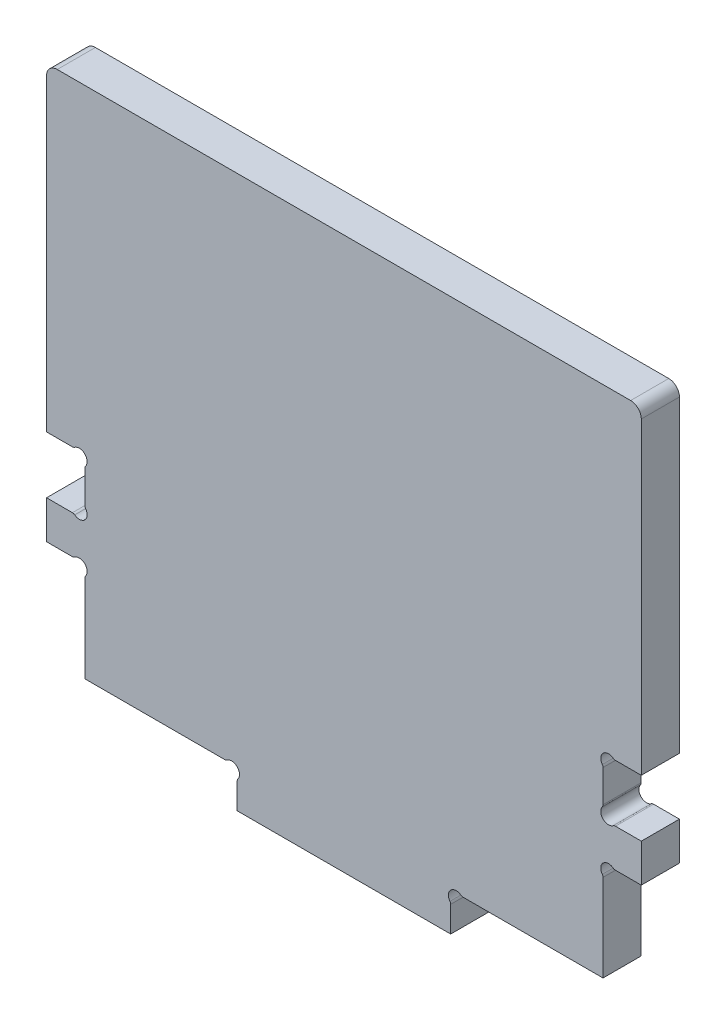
ISO-10303-21;
HEADER;
FILE_DESCRIPTION(('STEP AP214'),'2;1');
FILE_NAME('part.step','',(''),(''),'','','');
FILE_SCHEMA(('AUTOMOTIVE_DESIGN { 1 0 10303 214 1 1 1 1 }'));
ENDSEC;
DATA;
#1=APPLICATION_CONTEXT('core data for automotive mechanical design processes');
#2=APPLICATION_PROTOCOL_DEFINITION('international standard','automotive_design',2000,#1);
#3=PRODUCT_CONTEXT('',#1,'mechanical');
#4=PRODUCT('Part','Part','',(#3));
#5=PRODUCT_RELATED_PRODUCT_CATEGORY('part','',(#4));
#6=PRODUCT_DEFINITION_FORMATION('','',#4);
#7=PRODUCT_DEFINITION_CONTEXT('part definition',#1,'design');
#8=PRODUCT_DEFINITION('design','',#6,#7);
#9=PRODUCT_DEFINITION_SHAPE('','',#8);
#10=(LENGTH_UNIT() NAMED_UNIT(*) SI_UNIT(.MILLI.,.METRE.));
#11=(NAMED_UNIT(*) PLANE_ANGLE_UNIT() SI_UNIT($,.RADIAN.));
#12=(NAMED_UNIT(*) SI_UNIT($,.STERADIAN.) SOLID_ANGLE_UNIT());
#13=UNCERTAINTY_MEASURE_WITH_UNIT(LENGTH_MEASURE(1.E-05),#10,'distance_accuracy_value','');
#14=(GEOMETRIC_REPRESENTATION_CONTEXT(3) GLOBAL_UNCERTAINTY_ASSIGNED_CONTEXT((#13)) GLOBAL_UNIT_ASSIGNED_CONTEXT((#10,
#11,#12)) REPRESENTATION_CONTEXT('',''));
#15=CARTESIAN_POINT('',(0.,0.,0.));
#16=DIRECTION('',(0.,0.,1.));
#17=DIRECTION('',(1.,0.,0.));
#18=AXIS2_PLACEMENT_3D('',#15,#16,#17);
#19=CARTESIAN_POINT('',(0.,0.,25.));
#20=DIRECTION('',(0.,1.,0.));
#21=DIRECTION('',(0.,0.,1.));
#22=AXIS2_PLACEMENT_3D('',#19,#20,#21);
#23=PLANE('',#22);
#24=DIRECTION('',(1.,0.,0.));
#25=VECTOR('',#24,1.);
#26=CARTESIAN_POINT('',(0.,0.,0.));
#27=LINE('',#26,#25);
#28=CARTESIAN_POINT('',(0.,0.,0.));
#29=VERTEX_POINT('',#28);
#30=CARTESIAN_POINT('',(140.,0.,0.));
#31=VERTEX_POINT('',#30);
#32=EDGE_CURVE('E351',#29,#31,#27,.T.);
#33=ORIENTED_EDGE('',*,*,#32,.T.);
#34=DIRECTION('',(0.,0.,-1.));
#35=VECTOR('',#34,1.);
#36=CARTESIAN_POINT('',(140.,0.,25.));
#37=LINE('',#36,#35);
#38=CARTESIAN_POINT('',(140.,0.,25.));
#39=VERTEX_POINT('',#38);
#40=EDGE_CURVE('E333',#39,#31,#37,.T.);
#41=ORIENTED_EDGE('',*,*,#40,.F.);
#42=DIRECTION('',(1.,0.,0.));
#43=VECTOR('',#42,1.);
#44=CARTESIAN_POINT('',(0.,0.,25.));
#45=LINE('',#44,#43);
#46=CARTESIAN_POINT('',(0.,0.,25.));
#47=VERTEX_POINT('',#46);
#48=EDGE_CURVE('E339',#47,#39,#45,.T.);
#49=ORIENTED_EDGE('',*,*,#48,.F.);
#50=DIRECTION('',(0.,0.,-1.));
#51=VECTOR('',#50,1.);
#52=CARTESIAN_POINT('',(0.,0.,25.));
#53=LINE('',#52,#51);
#54=EDGE_CURVE('E439',#47,#29,#53,.T.);
#55=ORIENTED_EDGE('',*,*,#54,.T.);
#56=EDGE_LOOP('',(#33,#41,#49,#55));
#57=FACE_BOUND('',#56,.T.);
#58=ADVANCED_FACE('F33',(#57),#23,.F.);
#59=CARTESIAN_POINT('',(140.,16.8689596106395,25.));
#60=DIRECTION('',(-1.,0.,0.));
#61=DIRECTION('',(0.,0.,1.));
#62=AXIS2_PLACEMENT_3D('',#59,#60,#61);
#63=PLANE('',#62);
#64=DIRECTION('',(0.,1.,0.));
#65=VECTOR('',#64,1.);
#66=CARTESIAN_POINT('',(140.,16.8689596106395,0.));
#67=LINE('',#66,#65);
#68=CARTESIAN_POINT('',(140.,16.8689596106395,0.));
#69=VERTEX_POINT('',#68);
#70=EDGE_CURVE('E570',#31,#69,#67,.T.);
#71=ORIENTED_EDGE('',*,*,#70,.T.);
#72=DIRECTION('',(0.,0.,-1.));
#73=VECTOR('',#72,1.);
#74=CARTESIAN_POINT('',(140.,16.8689596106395,25.));
#75=LINE('',#74,#73);
#76=CARTESIAN_POINT('',(140.,16.8689596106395,25.));
#77=VERTEX_POINT('',#76);
#78=EDGE_CURVE('E336',#77,#69,#75,.T.);
#79=ORIENTED_EDGE('',*,*,#78,.F.);
#80=DIRECTION('',(0.,1.,0.));
#81=VECTOR('',#80,1.);
#82=CARTESIAN_POINT('',(140.,16.8689596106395,25.));
#83=LINE('',#82,#81);
#84=EDGE_CURVE('E329',#39,#77,#83,.T.);
#85=ORIENTED_EDGE('',*,*,#84,.F.);
#86=ORIENTED_EDGE('',*,*,#40,.T.);
#87=EDGE_LOOP('',(#71,#79,#85,#86));
#88=FACE_BOUND('',#87,.T.);
#89=ADVANCED_FACE('F331',(#88),#63,.F.);
#90=CARTESIAN_POINT('',(137.5,16.8689596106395,25.));
#91=DIRECTION('',(0.,0.,-1.));
#92=DIRECTION('',(-1.,0.,0.));
#93=AXIS2_PLACEMENT_3D('',#90,#91,#92);
#94=CYLINDRICAL_SURFACE('',#93,2.50000000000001);
#95=CARTESIAN_POINT('',(137.5,16.8689596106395,0.));
#96=DIRECTION('',(0.,0.,1.));
#97=DIRECTION('',(1.,0.,0.));
#98=AXIS2_PLACEMENT_3D('',#95,#96,#97);
#99=CIRCLE('',#98,2.50000000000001);
#100=CARTESIAN_POINT('',(139.508633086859,18.3573792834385,0.));
#101=VERTEX_POINT('',#100);
#102=EDGE_CURVE('E564',#69,#101,#99,.T.);
#103=ORIENTED_EDGE('',*,*,#102,.T.);
#104=DIRECTION('',(0.,0.,-1.));
#105=VECTOR('',#104,1.);
#106=CARTESIAN_POINT('',(139.508633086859,18.3573792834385,25.));
#107=LINE('',#106,#105);
#108=CARTESIAN_POINT('',(139.508633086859,18.3573792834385,25.));
#109=VERTEX_POINT('',#108);
#110=EDGE_CURVE('E356',#109,#101,#107,.T.);
#111=ORIENTED_EDGE('',*,*,#110,.F.);
#112=CARTESIAN_POINT('',(137.5,16.8689596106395,25.));
#113=DIRECTION('',(0.,0.,1.));
#114=DIRECTION('',(1.,0.,0.));
#115=AXIS2_PLACEMENT_3D('',#112,#113,#114);
#116=CIRCLE('',#115,2.50000000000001);
#117=EDGE_CURVE('E338',#77,#109,#116,.T.);
#118=ORIENTED_EDGE('',*,*,#117,.F.);
#119=ORIENTED_EDGE('',*,*,#78,.T.);
#120=EDGE_LOOP('',(#103,#111,#118,#119));
#121=FACE_BOUND('',#120,.T.);
#122=ADVANCED_FACE('F658',(#121),#94,.T.);
#123=CARTESIAN_POINT('',(143.606244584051,21.3937554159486,25.));
#124=DIRECTION('',(0.,0.,-1.));
#125=DIRECTION('',(-1.,0.,0.));
#126=AXIS2_PLACEMENT_3D('',#123,#124,#125);
#127=CYLINDRICAL_SURFACE('',#126,5.1);
#128=CARTESIAN_POINT('',(143.606244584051,21.3937554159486,0.));
#129=DIRECTION('',(0.,0.,-1.));
#130=DIRECTION('',(-1.,0.,0.));
#131=AXIS2_PLACEMENT_3D('',#128,#129,#130);
#132=CIRCLE('',#131,5.1);
#133=CARTESIAN_POINT('',(146.642620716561,25.491366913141,0.));
#134=VERTEX_POINT('',#133);
#135=EDGE_CURVE('E559',#101,#134,#132,.T.);
#136=ORIENTED_EDGE('',*,*,#135,.T.);
#137=DIRECTION('',(0.,0.,-1.));
#138=VECTOR('',#137,1.);
#139=CARTESIAN_POINT('',(146.642620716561,25.491366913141,25.));
#140=LINE('',#139,#138);
#141=CARTESIAN_POINT('',(146.642620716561,25.491366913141,25.));
#142=VERTEX_POINT('',#141);
#143=EDGE_CURVE('E550',#142,#134,#140,.T.);
#144=ORIENTED_EDGE('',*,*,#143,.F.);
#145=CARTESIAN_POINT('',(143.606244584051,21.3937554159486,25.));
#146=DIRECTION('',(0.,0.,-1.));
#147=DIRECTION('',(-1.,0.,0.));
#148=AXIS2_PLACEMENT_3D('',#145,#146,#147);
#149=CIRCLE('',#148,5.1);
#150=EDGE_CURVE('E560',#109,#142,#149,.T.);
#151=ORIENTED_EDGE('',*,*,#150,.F.);
#152=ORIENTED_EDGE('',*,*,#110,.T.);
#153=EDGE_LOOP('',(#136,#144,#151,#152));
#154=FACE_BOUND('',#153,.T.);
#155=ADVANCED_FACE('F557',(#154),#127,.F.);
#156=CARTESIAN_POINT('',(148.131040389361,27.5,25.));
#157=DIRECTION('',(0.,0.,-1.));
#158=DIRECTION('',(-1.,0.,0.));
#159=AXIS2_PLACEMENT_3D('',#156,#157,#158);
#160=CYLINDRICAL_SURFACE('',#159,2.49999999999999);
#161=CARTESIAN_POINT('',(148.131040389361,27.5,0.));
#162=DIRECTION('',(0.,0.,1.));
#163=DIRECTION('',(1.,0.,0.));
#164=AXIS2_PLACEMENT_3D('',#161,#162,#163);
#165=CIRCLE('',#164,2.49999999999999);
#166=CARTESIAN_POINT('',(148.131040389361,25.,0.));
#167=VERTEX_POINT('',#166);
#168=EDGE_CURVE('E566',#134,#167,#165,.T.);
#169=ORIENTED_EDGE('',*,*,#168,.T.);
#170=DIRECTION('',(0.,0.,-1.));
#171=VECTOR('',#170,1.);
#172=CARTESIAN_POINT('',(148.131040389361,25.,25.));
#173=LINE('',#172,#171);
#174=CARTESIAN_POINT('',(148.131040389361,25.,25.));
#175=VERTEX_POINT('',#174);
#176=EDGE_CURVE('E547',#175,#167,#173,.T.);
#177=ORIENTED_EDGE('',*,*,#176,.F.);
#178=CARTESIAN_POINT('',(148.131040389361,27.5,25.));
#179=DIRECTION('',(0.,0.,1.));
#180=DIRECTION('',(1.,0.,0.));
#181=AXIS2_PLACEMENT_3D('',#178,#179,#180);
#182=CIRCLE('',#181,2.49999999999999);
#183=EDGE_CURVE('E660',#142,#175,#182,.T.);
#184=ORIENTED_EDGE('',*,*,#183,.F.);
#185=ORIENTED_EDGE('',*,*,#143,.T.);
#186=EDGE_LOOP('',(#169,#177,#184,#185));
#187=FACE_BOUND('',#186,.T.);
#188=ADVANCED_FACE('F759',(#187),#160,.T.);
#189=CARTESIAN_POINT('',(148.131040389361,25.,25.));
#190=DIRECTION('',(0.,1.,0.));
#191=DIRECTION('',(0.,0.,1.));
#192=AXIS2_PLACEMENT_3D('',#189,#190,#191);
#193=PLANE('',#192);
#194=DIRECTION('',(1.,0.,0.));
#195=VECTOR('',#194,1.);
#196=CARTESIAN_POINT('',(148.131040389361,25.,0.));
#197=LINE('',#196,#195);
#198=CARTESIAN_POINT('',(239.9,25.,0.));
#199=VERTEX_POINT('',#198);
#200=EDGE_CURVE('E568',#167,#199,#197,.T.);
#201=ORIENTED_EDGE('',*,*,#200,.T.);
#202=DIRECTION('',(0.,0.,-1.));
#203=VECTOR('',#202,1.);
#204=CARTESIAN_POINT('',(239.9,25.,25.));
#205=LINE('',#204,#203);
#206=CARTESIAN_POINT('',(239.9,25.,25.));
#207=VERTEX_POINT('',#206);
#208=EDGE_CURVE('E544',#207,#199,#205,.T.);
#209=ORIENTED_EDGE('',*,*,#208,.F.);
#210=DIRECTION('',(1.,0.,0.));
#211=VECTOR('',#210,1.);
#212=CARTESIAN_POINT('',(148.131040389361,25.,25.));
#213=LINE('',#212,#211);
#214=EDGE_CURVE('E664',#175,#207,#213,.T.);
#215=ORIENTED_EDGE('',*,*,#214,.F.);
#216=ORIENTED_EDGE('',*,*,#176,.T.);
#217=EDGE_LOOP('',(#201,#209,#215,#216));
#218=FACE_BOUND('',#217,.T.);
#219=ADVANCED_FACE('F754',(#218),#193,.F.);
#220=CARTESIAN_POINT('',(239.9,82.1466291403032,25.));
#221=DIRECTION('',(-1.,0.,0.));
#222=DIRECTION('',(0.,0.,1.));
#223=AXIS2_PLACEMENT_3D('',#220,#221,#222);
#224=PLANE('',#223);
#225=DIRECTION('',(0.,1.,0.));
#226=VECTOR('',#225,1.);
#227=CARTESIAN_POINT('',(239.9,82.1466291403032,0.));
#228=LINE('',#227,#226);
#229=CARTESIAN_POINT('',(239.9,82.1466291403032,0.));
#230=VERTEX_POINT('',#229);
#231=EDGE_CURVE('E575',#199,#230,#228,.T.);
#232=ORIENTED_EDGE('',*,*,#231,.T.);
#233=DIRECTION('',(0.,0.,-1.));
#234=VECTOR('',#233,1.);
#235=CARTESIAN_POINT('',(239.9,82.1466291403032,25.));
#236=LINE('',#235,#234);
#237=CARTESIAN_POINT('',(239.9,82.1466291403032,25.));
#238=VERTEX_POINT('',#237);
#239=EDGE_CURVE('E541',#238,#230,#236,.T.);
#240=ORIENTED_EDGE('',*,*,#239,.F.);
#241=DIRECTION('',(0.,1.,0.));
#242=VECTOR('',#241,1.);
#243=CARTESIAN_POINT('',(239.9,82.1466291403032,25.));
#244=LINE('',#243,#242);
#245=EDGE_CURVE('E666',#207,#238,#244,.T.);
#246=ORIENTED_EDGE('',*,*,#245,.F.);
#247=ORIENTED_EDGE('',*,*,#208,.T.);
#248=EDGE_LOOP('',(#232,#240,#246,#247));
#249=FACE_BOUND('',#248,.T.);
#250=ADVANCED_FACE('F751',(#249),#224,.F.);
#251=CARTESIAN_POINT('',(237.4,82.1466291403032,25.));
#252=DIRECTION('',(0.,0.,-1.));
#253=DIRECTION('',(-1.,0.,0.));
#254=AXIS2_PLACEMENT_3D('',#251,#252,#253);
#255=CYLINDRICAL_SURFACE('',#254,2.50000000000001);
#256=CARTESIAN_POINT('',(237.4,82.1466291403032,0.));
#257=DIRECTION('',(0.,0.,1.));
#258=DIRECTION('',(1.,0.,0.));
#259=AXIS2_PLACEMENT_3D('',#256,#257,#258);
#260=CIRCLE('',#259,2.50000000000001);
#261=CARTESIAN_POINT('',(239.408633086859,83.6350488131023,0.));
#262=VERTEX_POINT('',#261);
#263=EDGE_CURVE('E577',#230,#262,#260,.T.);
#264=ORIENTED_EDGE('',*,*,#263,.T.);
#265=DIRECTION('',(0.,0.,-1.));
#266=VECTOR('',#265,1.);
#267=CARTESIAN_POINT('',(239.408633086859,83.6350488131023,25.));
#268=LINE('',#267,#266);
#269=CARTESIAN_POINT('',(239.408633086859,83.6350488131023,25.));
#270=VERTEX_POINT('',#269);
#271=EDGE_CURVE('E538',#270,#262,#268,.T.);
#272=ORIENTED_EDGE('',*,*,#271,.F.);
#273=CARTESIAN_POINT('',(237.4,82.1466291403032,25.));
#274=DIRECTION('',(0.,0.,1.));
#275=DIRECTION('',(1.,0.,0.));
#276=AXIS2_PLACEMENT_3D('',#273,#274,#275);
#277=CIRCLE('',#276,2.50000000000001);
#278=EDGE_CURVE('E668',#238,#270,#277,.T.);
#279=ORIENTED_EDGE('',*,*,#278,.F.);
#280=ORIENTED_EDGE('',*,*,#239,.T.);
#281=EDGE_LOOP('',(#264,#272,#279,#280));
#282=FACE_BOUND('',#281,.T.);
#283=ADVANCED_FACE('F747',(#282),#255,.T.);
#284=CARTESIAN_POINT('',(243.506244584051,86.6714249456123,25.));
#285=DIRECTION('',(0.,0.,-1.));
#286=DIRECTION('',(-1.,0.,0.));
#287=AXIS2_PLACEMENT_3D('',#284,#285,#286);
#288=CYLINDRICAL_SURFACE('',#287,5.09999999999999);
#289=CARTESIAN_POINT('',(243.506244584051,86.6714249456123,0.));
#290=DIRECTION('',(0.,0.,-1.));
#291=DIRECTION('',(-1.,0.,0.));
#292=AXIS2_PLACEMENT_3D('',#289,#290,#291);
#293=CIRCLE('',#292,5.09999999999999);
#294=CARTESIAN_POINT('',(246.542620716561,90.7690364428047,0.));
#295=VERTEX_POINT('',#294);
#296=EDGE_CURVE('E579',#262,#295,#293,.T.);
#297=ORIENTED_EDGE('',*,*,#296,.T.);
#298=DIRECTION('',(0.,0.,-1.));
#299=VECTOR('',#298,1.);
#300=CARTESIAN_POINT('',(246.542620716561,90.7690364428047,25.));
#301=LINE('',#300,#299);
#302=CARTESIAN_POINT('',(246.542620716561,90.7690364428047,25.));
#303=VERTEX_POINT('',#302);
#304=EDGE_CURVE('E535',#303,#295,#301,.T.);
#305=ORIENTED_EDGE('',*,*,#304,.F.);
#306=CARTESIAN_POINT('',(243.506244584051,86.6714249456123,25.));
#307=DIRECTION('',(0.,0.,-1.));
#308=DIRECTION('',(-1.,0.,0.));
#309=AXIS2_PLACEMENT_3D('',#306,#307,#308);
#310=CIRCLE('',#309,5.09999999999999);
#311=EDGE_CURVE('E670',#270,#303,#310,.T.);
#312=ORIENTED_EDGE('',*,*,#311,.F.);
#313=ORIENTED_EDGE('',*,*,#271,.T.);
#314=EDGE_LOOP('',(#297,#305,#312,#313));
#315=FACE_BOUND('',#314,.T.);
#316=ADVANCED_FACE('F742',(#315),#288,.F.);
#317=CARTESIAN_POINT('',(248.031040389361,92.7776695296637,25.));
#318=DIRECTION('',(0.,0.,-1.));
#319=DIRECTION('',(-1.,0.,0.));
#320=AXIS2_PLACEMENT_3D('',#317,#318,#319);
#321=CYLINDRICAL_SURFACE('',#320,2.50000000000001);
#322=CARTESIAN_POINT('',(248.031040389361,92.7776695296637,0.));
#323=DIRECTION('',(0.,0.,1.));
#324=DIRECTION('',(1.,0.,0.));
#325=AXIS2_PLACEMENT_3D('',#322,#323,#324);
#326=CIRCLE('',#325,2.50000000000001);
#327=CARTESIAN_POINT('',(248.031040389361,90.2776695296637,0.));
#328=VERTEX_POINT('',#327);
#329=EDGE_CURVE('E581',#295,#328,#326,.T.);
#330=ORIENTED_EDGE('',*,*,#329,.T.);
#331=DIRECTION('',(0.,0.,-1.));
#332=VECTOR('',#331,1.);
#333=CARTESIAN_POINT('',(248.031040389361,90.2776695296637,25.));
#334=LINE('',#333,#332);
#335=CARTESIAN_POINT('',(248.031040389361,90.2776695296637,25.));
#336=VERTEX_POINT('',#335);
#337=EDGE_CURVE('E532',#336,#328,#334,.T.);
#338=ORIENTED_EDGE('',*,*,#337,.F.);
#339=CARTESIAN_POINT('',(248.031040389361,92.7776695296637,25.));
#340=DIRECTION('',(0.,0.,1.));
#341=DIRECTION('',(1.,0.,0.));
#342=AXIS2_PLACEMENT_3D('',#339,#340,#341);
#343=CIRCLE('',#342,2.50000000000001);
#344=EDGE_CURVE('E672',#303,#336,#343,.T.);
#345=ORIENTED_EDGE('',*,*,#344,.F.);
#346=ORIENTED_EDGE('',*,*,#304,.T.);
#347=EDGE_LOOP('',(#330,#338,#345,#346));
#348=FACE_BOUND('',#347,.T.);
#349=ADVANCED_FACE('F736',(#348),#321,.T.);
#350=CARTESIAN_POINT('',(248.031040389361,90.2776695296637,25.));
#351=DIRECTION('',(0.,1.,0.));
#352=DIRECTION('',(-1.,0.,0.));
#353=AXIS2_PLACEMENT_3D('',#350,#351,#352);
#354=PLANE('',#353);
#355=DIRECTION('',(1.,0.,0.));
#356=VECTOR('',#355,1.);
#357=CARTESIAN_POINT('',(248.031040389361,90.2776695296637,0.));
#358=LINE('',#357,#356);
#359=CARTESIAN_POINT('',(265.,90.2776695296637,0.));
#360=VERTEX_POINT('',#359);
#361=EDGE_CURVE('E583',#328,#360,#358,.T.);
#362=ORIENTED_EDGE('',*,*,#361,.T.);
#363=DIRECTION('',(0.,0.,-1.));
#364=VECTOR('',#363,1.);
#365=CARTESIAN_POINT('',(265.,90.2776695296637,25.));
#366=LINE('',#365,#364);
#367=CARTESIAN_POINT('',(265.,90.2776695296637,25.));
#368=VERTEX_POINT('',#367);
#369=EDGE_CURVE('E529',#368,#360,#366,.T.);
#370=ORIENTED_EDGE('',*,*,#369,.F.);
#371=DIRECTION('',(1.,0.,0.));
#372=VECTOR('',#371,1.);
#373=CARTESIAN_POINT('',(248.031040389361,90.2776695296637,25.));
#374=LINE('',#373,#372);
#375=EDGE_CURVE('E674',#336,#368,#374,.T.);
#376=ORIENTED_EDGE('',*,*,#375,.F.);
#377=ORIENTED_EDGE('',*,*,#337,.T.);
#378=EDGE_LOOP('',(#362,#370,#376,#377));
#379=FACE_BOUND('',#378,.T.);
#380=ADVANCED_FACE('F732',(#379),#354,.F.);
#381=CARTESIAN_POINT('',(265.,90.2776695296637,25.));
#382=DIRECTION('',(-1.,0.,0.));
#383=DIRECTION('',(0.,0.,1.));
#384=AXIS2_PLACEMENT_3D('',#381,#382,#383);
#385=PLANE('',#384);
#386=DIRECTION('',(0.,1.,0.));
#387=VECTOR('',#386,1.);
#388=CARTESIAN_POINT('',(265.,90.2776695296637,0.));
#389=LINE('',#388,#387);
#390=CARTESIAN_POINT('',(265.,115.277669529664,0.));
#391=VERTEX_POINT('',#390);
#392=EDGE_CURVE('E585',#360,#391,#389,.T.);
#393=ORIENTED_EDGE('',*,*,#392,.T.);
#394=DIRECTION('',(0.,0.,-1.));
#395=VECTOR('',#394,1.);
#396=CARTESIAN_POINT('',(265.,115.277669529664,25.));
#397=LINE('',#396,#395);
#398=CARTESIAN_POINT('',(265.,115.277669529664,25.));
#399=VERTEX_POINT('',#398);
#400=EDGE_CURVE('E526',#399,#391,#397,.T.);
#401=ORIENTED_EDGE('',*,*,#400,.F.);
#402=DIRECTION('',(0.,1.,0.));
#403=VECTOR('',#402,1.);
#404=CARTESIAN_POINT('',(265.,90.2776695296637,25.));
#405=LINE('',#404,#403);
#406=EDGE_CURVE('E676',#368,#399,#405,.T.);
#407=ORIENTED_EDGE('',*,*,#406,.F.);
#408=ORIENTED_EDGE('',*,*,#369,.T.);
#409=EDGE_LOOP('',(#393,#401,#407,#408));
#410=FACE_BOUND('',#409,.T.);
#411=ADVANCED_FACE('F727',(#410),#385,.F.);
#412=CARTESIAN_POINT('',(248.031040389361,115.277669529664,25.));
#413=DIRECTION('',(0.,-1.,0.));
#414=DIRECTION('',(1.,0.,0.));
#415=AXIS2_PLACEMENT_3D('',#412,#413,#414);
#416=PLANE('',#415);
#417=DIRECTION('',(-1.,0.,0.));
#418=VECTOR('',#417,1.);
#419=CARTESIAN_POINT('',(248.031040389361,115.277669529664,0.));
#420=LINE('',#419,#418);
#421=CARTESIAN_POINT('',(248.031040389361,115.277669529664,0.));
#422=VERTEX_POINT('',#421);
#423=EDGE_CURVE('E587',#391,#422,#420,.T.);
#424=ORIENTED_EDGE('',*,*,#423,.T.);
#425=DIRECTION('',(0.,0.,-1.));
#426=VECTOR('',#425,1.);
#427=CARTESIAN_POINT('',(248.031040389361,115.277669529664,25.));
#428=LINE('',#427,#426);
#429=CARTESIAN_POINT('',(248.031040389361,115.277669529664,25.));
#430=VERTEX_POINT('',#429);
#431=EDGE_CURVE('E523',#430,#422,#428,.T.);
#432=ORIENTED_EDGE('',*,*,#431,.F.);
#433=DIRECTION('',(-1.,0.,0.));
#434=VECTOR('',#433,1.);
#435=CARTESIAN_POINT('',(248.031040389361,115.277669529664,25.));
#436=LINE('',#435,#434);
#437=EDGE_CURVE('E678',#399,#430,#436,.T.);
#438=ORIENTED_EDGE('',*,*,#437,.F.);
#439=ORIENTED_EDGE('',*,*,#400,.T.);
#440=EDGE_LOOP('',(#424,#432,#438,#439));
#441=FACE_BOUND('',#440,.T.);
#442=ADVANCED_FACE('F721',(#441),#416,.F.);
#443=CARTESIAN_POINT('',(248.031040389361,112.777669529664,25.));
#444=DIRECTION('',(0.,0.,-1.));
#445=DIRECTION('',(-1.,0.,0.));
#446=AXIS2_PLACEMENT_3D('',#443,#444,#445);
#447=CYLINDRICAL_SURFACE('',#446,2.5);
#448=CARTESIAN_POINT('',(248.031040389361,112.777669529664,0.));
#449=DIRECTION('',(0.,0.,1.));
#450=DIRECTION('',(1.,0.,0.));
#451=AXIS2_PLACEMENT_3D('',#448,#449,#450);
#452=CIRCLE('',#451,2.5);
#453=CARTESIAN_POINT('',(246.542620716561,114.786302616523,0.));
#454=VERTEX_POINT('',#453);
#455=EDGE_CURVE('E589',#422,#454,#452,.T.);
#456=ORIENTED_EDGE('',*,*,#455,.T.);
#457=DIRECTION('',(0.,0.,-1.));
#458=VECTOR('',#457,1.);
#459=CARTESIAN_POINT('',(246.542620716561,114.786302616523,25.));
#460=LINE('',#459,#458);
#461=CARTESIAN_POINT('',(246.542620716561,114.786302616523,25.));
#462=VERTEX_POINT('',#461);
#463=EDGE_CURVE('E520',#462,#454,#460,.T.);
#464=ORIENTED_EDGE('',*,*,#463,.F.);
#465=CARTESIAN_POINT('',(248.031040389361,112.777669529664,25.));
#466=DIRECTION('',(0.,0.,1.));
#467=DIRECTION('',(1.,0.,0.));
#468=AXIS2_PLACEMENT_3D('',#465,#466,#467);
#469=CIRCLE('',#468,2.5);
#470=EDGE_CURVE('E680',#430,#462,#469,.T.);
#471=ORIENTED_EDGE('',*,*,#470,.F.);
#472=ORIENTED_EDGE('',*,*,#431,.T.);
#473=EDGE_LOOP('',(#456,#464,#471,#472));
#474=FACE_BOUND('',#473,.T.);
#475=ADVANCED_FACE('F717',(#474),#447,.T.);
#476=CARTESIAN_POINT('',(243.506244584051,118.883914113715,25.));
#477=DIRECTION('',(0.,0.,-1.));
#478=DIRECTION('',(-1.,0.,0.));
#479=AXIS2_PLACEMENT_3D('',#476,#477,#478);
#480=CYLINDRICAL_SURFACE('',#479,5.10000000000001);
#481=CARTESIAN_POINT('',(243.506244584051,118.883914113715,0.));
#482=DIRECTION('',(0.,0.,-1.));
#483=DIRECTION('',(-1.,0.,0.));
#484=AXIS2_PLACEMENT_3D('',#481,#482,#483);
#485=CIRCLE('',#484,5.10000000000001);
#486=CARTESIAN_POINT('',(239.408633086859,121.920290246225,0.));
#487=VERTEX_POINT('',#486);
#488=EDGE_CURVE('E591',#454,#487,#485,.T.);
#489=ORIENTED_EDGE('',*,*,#488,.T.);
#490=DIRECTION('',(0.,0.,-1.));
#491=VECTOR('',#490,1.);
#492=CARTESIAN_POINT('',(239.408633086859,121.920290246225,25.));
#493=LINE('',#492,#491);
#494=CARTESIAN_POINT('',(239.408633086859,121.920290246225,25.));
#495=VERTEX_POINT('',#494);
#496=EDGE_CURVE('E517',#495,#487,#493,.T.);
#497=ORIENTED_EDGE('',*,*,#496,.F.);
#498=CARTESIAN_POINT('',(243.506244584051,118.883914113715,25.));
#499=DIRECTION('',(0.,0.,-1.));
#500=DIRECTION('',(-1.,0.,0.));
#501=AXIS2_PLACEMENT_3D('',#498,#499,#500);
#502=CIRCLE('',#501,5.10000000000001);
#503=EDGE_CURVE('E682',#462,#495,#502,.T.);
#504=ORIENTED_EDGE('',*,*,#503,.F.);
#505=ORIENTED_EDGE('',*,*,#463,.T.);
#506=EDGE_LOOP('',(#489,#497,#504,#505));
#507=FACE_BOUND('',#506,.T.);
#508=ADVANCED_FACE('F712',(#507),#480,.F.);
#509=CARTESIAN_POINT('',(237.4,123.408709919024,25.));
#510=DIRECTION('',(0.,0.,-1.));
#511=DIRECTION('',(-1.,0.,0.));
#512=AXIS2_PLACEMENT_3D('',#509,#510,#511);
#513=CYLINDRICAL_SURFACE('',#512,2.5);
#514=CARTESIAN_POINT('',(237.4,123.408709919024,0.));
#515=DIRECTION('',(0.,0.,1.));
#516=DIRECTION('',(1.,0.,0.));
#517=AXIS2_PLACEMENT_3D('',#514,#515,#516);
#518=CIRCLE('',#517,2.5);
#519=CARTESIAN_POINT('',(239.9,123.408709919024,0.));
#520=VERTEX_POINT('',#519);
#521=EDGE_CURVE('E593',#487,#520,#518,.T.);
#522=ORIENTED_EDGE('',*,*,#521,.T.);
#523=DIRECTION('',(0.,0.,-1.));
#524=VECTOR('',#523,1.);
#525=CARTESIAN_POINT('',(239.9,123.408709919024,25.));
#526=LINE('',#525,#524);
#527=CARTESIAN_POINT('',(239.9,123.408709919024,25.));
#528=VERTEX_POINT('',#527);
#529=EDGE_CURVE('E514',#528,#520,#526,.T.);
#530=ORIENTED_EDGE('',*,*,#529,.F.);
#531=CARTESIAN_POINT('',(237.4,123.408709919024,25.));
#532=DIRECTION('',(0.,0.,1.));
#533=DIRECTION('',(1.,0.,0.));
#534=AXIS2_PLACEMENT_3D('',#531,#532,#533);
#535=CIRCLE('',#534,2.5);
#536=EDGE_CURVE('E684',#495,#528,#535,.T.);
#537=ORIENTED_EDGE('',*,*,#536,.F.);
#538=ORIENTED_EDGE('',*,*,#496,.T.);
#539=EDGE_LOOP('',(#522,#530,#537,#538));
#540=FACE_BOUND('',#539,.T.);
#541=ADVANCED_FACE('F706',(#540),#513,.T.);
#542=CARTESIAN_POINT('',(239.9,123.408709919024,25.));
#543=DIRECTION('',(-1.,0.,0.));
#544=DIRECTION('',(0.,-1.,0.));
#545=AXIS2_PLACEMENT_3D('',#542,#543,#544);
#546=PLANE('',#545);
#547=DIRECTION('',(0.,1.,0.));
#548=VECTOR('',#547,1.);
#549=CARTESIAN_POINT('',(239.9,123.408709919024,0.));
#550=LINE('',#549,#548);
#551=CARTESIAN_POINT('',(239.9,144.524298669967,0.));
#552=VERTEX_POINT('',#551);
#553=EDGE_CURVE('E595',#520,#552,#550,.T.);
#554=ORIENTED_EDGE('',*,*,#553,.T.);
#555=DIRECTION('',(0.,0.,-1.));
#556=VECTOR('',#555,1.);
#557=CARTESIAN_POINT('',(239.9,144.524298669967,25.));
#558=LINE('',#557,#556);
#559=CARTESIAN_POINT('',(239.9,144.524298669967,25.));
#560=VERTEX_POINT('',#559);
#561=EDGE_CURVE('E511',#560,#552,#558,.T.);
#562=ORIENTED_EDGE('',*,*,#561,.F.);
#563=DIRECTION('',(0.,1.,0.));
#564=VECTOR('',#563,1.);
#565=CARTESIAN_POINT('',(239.9,123.408709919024,25.));
#566=LINE('',#565,#564);
#567=EDGE_CURVE('E686',#528,#560,#566,.T.);
#568=ORIENTED_EDGE('',*,*,#567,.F.);
#569=ORIENTED_EDGE('',*,*,#529,.T.);
#570=EDGE_LOOP('',(#554,#562,#568,#569));
#571=FACE_BOUND('',#570,.T.);
#572=ADVANCED_FACE('F702',(#571),#546,.F.);
#573=CARTESIAN_POINT('',(237.4,144.524298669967,25.));
#574=DIRECTION('',(0.,0.,-1.));
#575=DIRECTION('',(-1.,0.,0.));
#576=AXIS2_PLACEMENT_3D('',#573,#574,#575);
#577=CYLINDRICAL_SURFACE('',#576,2.50000000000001);
#578=CARTESIAN_POINT('',(237.4,144.524298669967,0.));
#579=DIRECTION('',(0.,0.,1.));
#580=DIRECTION('',(1.,0.,0.));
#581=AXIS2_PLACEMENT_3D('',#578,#579,#580);
#582=CIRCLE('',#581,2.50000000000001);
#583=CARTESIAN_POINT('',(239.408633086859,146.012718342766,0.));
#584=VERTEX_POINT('',#583);
#585=EDGE_CURVE('E597',#552,#584,#582,.T.);
#586=ORIENTED_EDGE('',*,*,#585,.T.);
#587=DIRECTION('',(0.,0.,-1.));
#588=VECTOR('',#587,1.);
#589=CARTESIAN_POINT('',(239.408633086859,146.012718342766,25.));
#590=LINE('',#589,#588);
#591=CARTESIAN_POINT('',(239.408633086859,146.012718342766,25.));
#592=VERTEX_POINT('',#591);
#593=EDGE_CURVE('E508',#592,#584,#590,.T.);
#594=ORIENTED_EDGE('',*,*,#593,.F.);
#595=CARTESIAN_POINT('',(237.4,144.524298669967,25.));
#596=DIRECTION('',(0.,0.,1.));
#597=DIRECTION('',(1.,0.,0.));
#598=AXIS2_PLACEMENT_3D('',#595,#596,#597);
#599=CIRCLE('',#598,2.50000000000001);
#600=EDGE_CURVE('E688',#560,#592,#599,.T.);
#601=ORIENTED_EDGE('',*,*,#600,.F.);
#602=ORIENTED_EDGE('',*,*,#561,.T.);
#603=EDGE_LOOP('',(#586,#594,#601,#602));
#604=FACE_BOUND('',#603,.T.);
#605=ADVANCED_FACE('F698',(#604),#577,.T.);
#606=CARTESIAN_POINT('',(243.506244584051,149.049094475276,25.));
#607=DIRECTION('',(0.,0.,-1.));
#608=DIRECTION('',(-1.,0.,0.));
#609=AXIS2_PLACEMENT_3D('',#606,#607,#608);
#610=CYLINDRICAL_SURFACE('',#609,5.09999999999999);
#611=CARTESIAN_POINT('',(243.506244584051,149.049094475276,0.));
#612=DIRECTION('',(0.,0.,-1.));
#613=DIRECTION('',(-1.,0.,0.));
#614=AXIS2_PLACEMENT_3D('',#611,#612,#613);
#615=CIRCLE('',#614,5.09999999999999);
#616=CARTESIAN_POINT('',(246.542620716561,153.146705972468,0.));
#617=VERTEX_POINT('',#616);
#618=EDGE_CURVE('E599',#584,#617,#615,.T.);
#619=ORIENTED_EDGE('',*,*,#618,.T.);
#620=DIRECTION('',(0.,0.,-1.));
#621=VECTOR('',#620,1.);
#622=CARTESIAN_POINT('',(246.542620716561,153.146705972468,25.));
#623=LINE('',#622,#621);
#624=CARTESIAN_POINT('',(246.542620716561,153.146705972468,25.));
#625=VERTEX_POINT('',#624);
#626=EDGE_CURVE('E505',#625,#617,#623,.T.);
#627=ORIENTED_EDGE('',*,*,#626,.F.);
#628=CARTESIAN_POINT('',(243.506244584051,149.049094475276,25.));
#629=DIRECTION('',(0.,0.,-1.));
#630=DIRECTION('',(-1.,0.,0.));
#631=AXIS2_PLACEMENT_3D('',#628,#629,#630);
#632=CIRCLE('',#631,5.09999999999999);
#633=EDGE_CURVE('E614',#592,#625,#632,.T.);
#634=ORIENTED_EDGE('',*,*,#633,.F.);
#635=ORIENTED_EDGE('',*,*,#593,.T.);
#636=EDGE_LOOP('',(#619,#627,#634,#635));
#637=FACE_BOUND('',#636,.T.);
#638=ADVANCED_FACE('F693',(#637),#610,.F.);
#639=CARTESIAN_POINT('',(248.03104038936,155.155339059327,25.));
#640=DIRECTION('',(0.,0.,-1.));
#641=DIRECTION('',(-1.,0.,0.));
#642=AXIS2_PLACEMENT_3D('',#639,#640,#641);
#643=CYLINDRICAL_SURFACE('',#642,2.50000000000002);
#644=CARTESIAN_POINT('',(248.03104038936,155.155339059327,0.));
#645=DIRECTION('',(0.,0.,1.));
#646=DIRECTION('',(1.,0.,0.));
#647=AXIS2_PLACEMENT_3D('',#644,#645,#646);
#648=CIRCLE('',#647,2.50000000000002);
#649=CARTESIAN_POINT('',(248.03104038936,152.655339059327,0.));
#650=VERTEX_POINT('',#649);
#651=EDGE_CURVE('E395',#617,#650,#648,.T.);
#652=ORIENTED_EDGE('',*,*,#651,.T.);
#653=DIRECTION('',(0.,0.,-1.));
#654=VECTOR('',#653,1.);
#655=CARTESIAN_POINT('',(248.03104038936,152.655339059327,25.));
#656=LINE('',#655,#654);
#657=CARTESIAN_POINT('',(248.03104038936,152.655339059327,25.));
#658=VERTEX_POINT('',#657);
#659=EDGE_CURVE('E502',#658,#650,#656,.T.);
#660=ORIENTED_EDGE('',*,*,#659,.F.);
#661=CARTESIAN_POINT('',(248.03104038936,155.155339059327,25.));
#662=DIRECTION('',(0.,0.,1.));
#663=DIRECTION('',(1.,0.,0.));
#664=AXIS2_PLACEMENT_3D('',#661,#662,#663);
#665=CIRCLE('',#664,2.50000000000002);
#666=EDGE_CURVE('E611',#625,#658,#665,.T.);
#667=ORIENTED_EDGE('',*,*,#666,.F.);
#668=ORIENTED_EDGE('',*,*,#626,.T.);
#669=EDGE_LOOP('',(#652,#660,#667,#668));
#670=FACE_BOUND('',#669,.T.);
#671=ADVANCED_FACE('F603',(#670),#643,.T.);
#672=CARTESIAN_POINT('',(265.,152.655339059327,25.));
#673=DIRECTION('',(0.,1.,0.));
#674=DIRECTION('',(0.,0.,1.));
#675=AXIS2_PLACEMENT_3D('',#672,#673,#674);
#676=PLANE('',#675);
#677=DIRECTION('',(1.,0.,0.));
#678=VECTOR('',#677,1.);
#679=CARTESIAN_POINT('',(265.,152.655339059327,0.));
#680=LINE('',#679,#678);
#681=CARTESIAN_POINT('',(265.,152.655339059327,0.));
#682=VERTEX_POINT('',#681);
#683=EDGE_CURVE('E391',#650,#682,#680,.T.);
#684=ORIENTED_EDGE('',*,*,#683,.T.);
#685=DIRECTION('',(0.,0.,-1.));
#686=VECTOR('',#685,1.);
#687=CARTESIAN_POINT('',(265.,152.655339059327,25.));
#688=LINE('',#687,#686);
#689=CARTESIAN_POINT('',(265.,152.655339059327,25.));
#690=VERTEX_POINT('',#689);
#691=EDGE_CURVE('E390',#690,#682,#688,.T.);
#692=ORIENTED_EDGE('',*,*,#691,.F.);
#693=DIRECTION('',(1.,0.,0.));
#694=VECTOR('',#693,1.);
#695=CARTESIAN_POINT('',(265.,152.655339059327,25.));
#696=LINE('',#695,#694);
#697=EDGE_CURVE('E610',#658,#690,#696,.T.);
#698=ORIENTED_EDGE('',*,*,#697,.F.);
#699=ORIENTED_EDGE('',*,*,#659,.T.);
#700=EDGE_LOOP('',(#684,#692,#698,#699));
#701=FACE_BOUND('',#700,.T.);
#702=ADVANCED_FACE('F609',(#701),#676,.F.);
#703=CARTESIAN_POINT('',(265.,152.655339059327,25.));
#704=DIRECTION('',(-1.,0.,0.));
#705=DIRECTION('',(0.,0.,1.));
#706=AXIS2_PLACEMENT_3D('',#703,#704,#705);
#707=PLANE('',#706);
#708=DIRECTION('',(0.,1.,0.));
#709=VECTOR('',#708,1.);
#710=CARTESIAN_POINT('',(265.,152.655339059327,0.));
#711=LINE('',#710,#709);
#712=CARTESIAN_POINT('',(265.,355.,0.));
#713=VERTEX_POINT('',#712);
#714=EDGE_CURVE('E385',#682,#713,#711,.T.);
#715=ORIENTED_EDGE('',*,*,#714,.T.);
#716=DIRECTION('',(0.,0.,-1.));
#717=VECTOR('',#716,1.);
#718=CARTESIAN_POINT('',(265.,355.,25.));
#719=LINE('',#718,#717);
#720=CARTESIAN_POINT('',(265.,355.,25.));
#721=VERTEX_POINT('',#720);
#722=EDGE_CURVE('E56',#713,#721,#719,.F.);
#723=ORIENTED_EDGE('',*,*,#722,.T.);
#724=DIRECTION('',(0.,1.,0.));
#725=VECTOR('',#724,1.);
#726=CARTESIAN_POINT('',(265.,152.655339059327,25.));
#727=LINE('',#726,#725);
#728=EDGE_CURVE('E370',#690,#721,#727,.T.);
#729=ORIENTED_EDGE('',*,*,#728,.F.);
#730=ORIENTED_EDGE('',*,*,#691,.T.);
#731=EDGE_LOOP('',(#715,#723,#729,#730));
#732=FACE_BOUND('',#731,.T.);
#733=ADVANCED_FACE('F388',(#732),#707,.F.);
#734=CARTESIAN_POINT('',(-125.,362.,25.));
#735=DIRECTION('',(0.,-1.,0.));
#736=DIRECTION('',(0.,0.,-1.));
#737=AXIS2_PLACEMENT_3D('',#734,#735,#736);
#738=PLANE('',#737);
#739=DIRECTION('',(-1.,0.,0.));
#740=VECTOR('',#739,1.);
#741=CARTESIAN_POINT('',(-125.,362.,25.));
#742=LINE('',#741,#740);
#743=CARTESIAN_POINT('',(258.,362.,25.));
#744=VERTEX_POINT('',#743);
#745=CARTESIAN_POINT('',(-118.,362.,25.));
#746=VERTEX_POINT('',#745);
#747=EDGE_CURVE('E369',#744,#746,#742,.T.);
#748=ORIENTED_EDGE('',*,*,#747,.F.);
#749=DIRECTION('',(0.,0.,-1.));
#750=VECTOR('',#749,1.);
#751=CARTESIAN_POINT('',(258.,362.,25.));
#752=LINE('',#751,#750);
#753=CARTESIAN_POINT('',(258.,362.,0.));
#754=VERTEX_POINT('',#753);
#755=EDGE_CURVE('E354',#744,#754,#752,.T.);
#756=ORIENTED_EDGE('',*,*,#755,.T.);
#757=DIRECTION('',(-1.,0.,0.));
#758=VECTOR('',#757,1.);
#759=CARTESIAN_POINT('',(-125.,362.,0.));
#760=LINE('',#759,#758);
#761=CARTESIAN_POINT('',(-118.,362.,0.));
#762=VERTEX_POINT('',#761);
#763=EDGE_CURVE('E386',#754,#762,#760,.T.);
#764=ORIENTED_EDGE('',*,*,#763,.T.);
#765=DIRECTION('',(0.,0.,-1.));
#766=VECTOR('',#765,1.);
#767=CARTESIAN_POINT('',(-118.,362.,25.));
#768=LINE('',#767,#766);
#769=EDGE_CURVE('E352',#762,#746,#768,.F.);
#770=ORIENTED_EDGE('',*,*,#769,.T.);
#771=EDGE_LOOP('',(#748,#756,#764,#770));
#772=FACE_BOUND('',#771,.T.);
#773=ADVANCED_FACE('F374',(#772),#738,.F.);
#774=CARTESIAN_POINT('',(-125.,152.655339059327,25.));
#775=DIRECTION('',(1.,0.,0.));
#776=DIRECTION('',(0.,0.,-1.));
#777=AXIS2_PLACEMENT_3D('',#774,#775,#776);
#778=PLANE('',#777);
#779=DIRECTION('',(0.,-1.,0.));
#780=VECTOR('',#779,1.);
#781=CARTESIAN_POINT('',(-125.,152.655339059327,25.));
#782=LINE('',#781,#780);
#783=CARTESIAN_POINT('',(-125.,355.,25.));
#784=VERTEX_POINT('',#783);
#785=CARTESIAN_POINT('',(-125.,152.655339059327,25.));
#786=VERTEX_POINT('',#785);
#787=EDGE_CURVE('E378',#784,#786,#782,.T.);
#788=ORIENTED_EDGE('',*,*,#787,.F.);
#789=DIRECTION('',(0.,0.,-1.));
#790=VECTOR('',#789,1.);
#791=CARTESIAN_POINT('',(-125.,355.,25.));
#792=LINE('',#791,#790);
#793=CARTESIAN_POINT('',(-125.,355.,0.));
#794=VERTEX_POINT('',#793);
#795=EDGE_CURVE('E11',#784,#794,#792,.T.);
#796=ORIENTED_EDGE('',*,*,#795,.T.);
#797=DIRECTION('',(0.,-1.,0.));
#798=VECTOR('',#797,1.);
#799=CARTESIAN_POINT('',(-125.,152.655339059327,0.));
#800=LINE('',#799,#798);
#801=CARTESIAN_POINT('',(-125.,152.655339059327,0.));
#802=VERTEX_POINT('',#801);
#803=EDGE_CURVE('E393',#794,#802,#800,.T.);
#804=ORIENTED_EDGE('',*,*,#803,.T.);
#805=DIRECTION('',(0.,0.,-1.));
#806=VECTOR('',#805,1.);
#807=CARTESIAN_POINT('',(-125.,152.655339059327,25.));
#808=LINE('',#807,#806);
#809=EDGE_CURVE('E498',#786,#802,#808,.T.);
#810=ORIENTED_EDGE('',*,*,#809,.F.);
#811=EDGE_LOOP('',(#788,#796,#804,#810));
#812=FACE_BOUND('',#811,.T.);
#813=ADVANCED_FACE('F866',(#812),#778,.F.);
#814=CARTESIAN_POINT('',(-125.,152.655339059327,25.));
#815=DIRECTION('',(0.,1.,0.));
#816=DIRECTION('',(0.,0.,1.));
#817=AXIS2_PLACEMENT_3D('',#814,#815,#816);
#818=PLANE('',#817);
#819=DIRECTION('',(1.,0.,0.));
#820=VECTOR('',#819,1.);
#821=CARTESIAN_POINT('',(-125.,152.655339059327,0.));
#822=LINE('',#821,#820);
#823=CARTESIAN_POINT('',(-108.03104038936,152.655339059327,0.));
#824=VERTEX_POINT('',#823);
#825=EDGE_CURVE('E400',#802,#824,#822,.T.);
#826=ORIENTED_EDGE('',*,*,#825,.T.);
#827=DIRECTION('',(0.,0.,-1.));
#828=VECTOR('',#827,1.);
#829=CARTESIAN_POINT('',(-108.03104038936,152.655339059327,25.));
#830=LINE('',#829,#828);
#831=CARTESIAN_POINT('',(-108.03104038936,152.655339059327,25.));
#832=VERTEX_POINT('',#831);
#833=EDGE_CURVE('E495',#832,#824,#830,.T.);
#834=ORIENTED_EDGE('',*,*,#833,.F.);
#835=DIRECTION('',(1.,0.,0.));
#836=VECTOR('',#835,1.);
#837=CARTESIAN_POINT('',(-125.,152.655339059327,25.));
#838=LINE('',#837,#836);
#839=EDGE_CURVE('E619',#786,#832,#838,.T.);
#840=ORIENTED_EDGE('',*,*,#839,.F.);
#841=ORIENTED_EDGE('',*,*,#809,.T.);
#842=EDGE_LOOP('',(#826,#834,#840,#841));
#843=FACE_BOUND('',#842,.T.);
#844=ADVANCED_FACE('F862',(#843),#818,.F.);
#845=CARTESIAN_POINT('',(-108.03104038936,155.155339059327,25.));
#846=DIRECTION('',(0.,0.,-1.));
#847=DIRECTION('',(-1.,0.,0.));
#848=AXIS2_PLACEMENT_3D('',#845,#846,#847);
#849=CYLINDRICAL_SURFACE('',#848,2.50000000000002);
#850=CARTESIAN_POINT('',(-108.03104038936,155.155339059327,0.));
#851=DIRECTION('',(0.,0.,1.));
#852=DIRECTION('',(-1.,0.,0.));
#853=AXIS2_PLACEMENT_3D('',#850,#851,#852);
#854=CIRCLE('',#853,2.50000000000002);
#855=CARTESIAN_POINT('',(-106.542620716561,153.146705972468,0.));
#856=VERTEX_POINT('',#855);
#857=EDGE_CURVE('E402',#824,#856,#854,.T.);
#858=ORIENTED_EDGE('',*,*,#857,.T.);
#859=DIRECTION('',(0.,0.,-1.));
#860=VECTOR('',#859,1.);
#861=CARTESIAN_POINT('',(-106.542620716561,153.146705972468,25.));
#862=LINE('',#861,#860);
#863=CARTESIAN_POINT('',(-106.542620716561,153.146705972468,25.));
#864=VERTEX_POINT('',#863);
#865=EDGE_CURVE('E492',#864,#856,#862,.T.);
#866=ORIENTED_EDGE('',*,*,#865,.F.);
#867=CARTESIAN_POINT('',(-108.03104038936,155.155339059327,25.));
#868=DIRECTION('',(0.,0.,1.));
#869=DIRECTION('',(-1.,0.,0.));
#870=AXIS2_PLACEMENT_3D('',#867,#868,#869);
#871=CIRCLE('',#870,2.50000000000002);
#872=EDGE_CURVE('E621',#832,#864,#871,.T.);
#873=ORIENTED_EDGE('',*,*,#872,.F.);
#874=ORIENTED_EDGE('',*,*,#833,.T.);
#875=EDGE_LOOP('',(#858,#866,#873,#874));
#876=FACE_BOUND('',#875,.T.);
#877=ADVANCED_FACE('F858',(#876),#849,.T.);
#878=CARTESIAN_POINT('',(-103.506244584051,149.049094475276,25.));
#879=DIRECTION('',(0.,0.,-1.));
#880=DIRECTION('',(-1.,0.,0.));
#881=AXIS2_PLACEMENT_3D('',#878,#879,#880);
#882=CYLINDRICAL_SURFACE('',#881,5.09999999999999);
#883=CARTESIAN_POINT('',(-103.506244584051,149.049094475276,0.));
#884=DIRECTION('',(0.,0.,-1.));
#885=DIRECTION('',(1.,0.,0.));
#886=AXIS2_PLACEMENT_3D('',#883,#884,#885);
#887=CIRCLE('',#886,5.09999999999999);
#888=CARTESIAN_POINT('',(-99.408633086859,146.012718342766,0.));
#889=VERTEX_POINT('',#888);
#890=EDGE_CURVE('E404',#856,#889,#887,.T.);
#891=ORIENTED_EDGE('',*,*,#890,.T.);
#892=DIRECTION('',(0.,0.,-1.));
#893=VECTOR('',#892,1.);
#894=CARTESIAN_POINT('',(-99.408633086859,146.012718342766,25.));
#895=LINE('',#894,#893);
#896=CARTESIAN_POINT('',(-99.408633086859,146.012718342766,25.));
#897=VERTEX_POINT('',#896);
#898=EDGE_CURVE('E489',#897,#889,#895,.T.);
#899=ORIENTED_EDGE('',*,*,#898,.F.);
#900=CARTESIAN_POINT('',(-103.506244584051,149.049094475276,25.));
#901=DIRECTION('',(0.,0.,-1.));
#902=DIRECTION('',(1.,0.,0.));
#903=AXIS2_PLACEMENT_3D('',#900,#901,#902);
#904=CIRCLE('',#903,5.09999999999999);
#905=EDGE_CURVE('E623',#864,#897,#904,.T.);
#906=ORIENTED_EDGE('',*,*,#905,.F.);
#907=ORIENTED_EDGE('',*,*,#865,.T.);
#908=EDGE_LOOP('',(#891,#899,#906,#907));
#909=FACE_BOUND('',#908,.T.);
#910=ADVANCED_FACE('F854',(#909),#882,.F.);
#911=CARTESIAN_POINT('',(-97.4,144.524298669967,25.));
#912=DIRECTION('',(0.,0.,-1.));
#913=DIRECTION('',(-1.,0.,0.));
#914=AXIS2_PLACEMENT_3D('',#911,#912,#913);
#915=CYLINDRICAL_SURFACE('',#914,2.50000000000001);
#916=CARTESIAN_POINT('',(-97.4,144.524298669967,0.));
#917=DIRECTION('',(0.,0.,1.));
#918=DIRECTION('',(-1.,0.,0.));
#919=AXIS2_PLACEMENT_3D('',#916,#917,#918);
#920=CIRCLE('',#919,2.50000000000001);
#921=CARTESIAN_POINT('',(-99.9,144.524298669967,0.));
#922=VERTEX_POINT('',#921);
#923=EDGE_CURVE('E406',#889,#922,#920,.T.);
#924=ORIENTED_EDGE('',*,*,#923,.T.);
#925=DIRECTION('',(0.,0.,-1.));
#926=VECTOR('',#925,1.);
#927=CARTESIAN_POINT('',(-99.9,144.524298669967,25.));
#928=LINE('',#927,#926);
#929=CARTESIAN_POINT('',(-99.9,144.524298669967,25.));
#930=VERTEX_POINT('',#929);
#931=EDGE_CURVE('E486',#930,#922,#928,.T.);
#932=ORIENTED_EDGE('',*,*,#931,.F.);
#933=CARTESIAN_POINT('',(-97.4,144.524298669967,25.));
#934=DIRECTION('',(0.,0.,1.));
#935=DIRECTION('',(-1.,0.,0.));
#936=AXIS2_PLACEMENT_3D('',#933,#934,#935);
#937=CIRCLE('',#936,2.50000000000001);
#938=EDGE_CURVE('E625',#897,#930,#937,.T.);
#939=ORIENTED_EDGE('',*,*,#938,.F.);
#940=ORIENTED_EDGE('',*,*,#898,.T.);
#941=EDGE_LOOP('',(#924,#932,#939,#940));
#942=FACE_BOUND('',#941,.T.);
#943=ADVANCED_FACE('F850',(#942),#915,.T.);
#944=CARTESIAN_POINT('',(-99.9,123.408709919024,25.));
#945=DIRECTION('',(1.,0.,0.));
#946=DIRECTION('',(0.,1.,0.));
#947=AXIS2_PLACEMENT_3D('',#944,#945,#946);
#948=PLANE('',#947);
#949=DIRECTION('',(0.,-1.,0.));
#950=VECTOR('',#949,1.);
#951=CARTESIAN_POINT('',(-99.9,123.408709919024,0.));
#952=LINE('',#951,#950);
#953=CARTESIAN_POINT('',(-99.9,123.408709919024,0.));
#954=VERTEX_POINT('',#953);
#955=EDGE_CURVE('E408',#922,#954,#952,.T.);
#956=ORIENTED_EDGE('',*,*,#955,.T.);
#957=DIRECTION('',(0.,0.,-1.));
#958=VECTOR('',#957,1.);
#959=CARTESIAN_POINT('',(-99.9,123.408709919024,25.));
#960=LINE('',#959,#958);
#961=CARTESIAN_POINT('',(-99.9,123.408709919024,25.));
#962=VERTEX_POINT('',#961);
#963=EDGE_CURVE('E483',#962,#954,#960,.T.);
#964=ORIENTED_EDGE('',*,*,#963,.F.);
#965=DIRECTION('',(0.,-1.,0.));
#966=VECTOR('',#965,1.);
#967=CARTESIAN_POINT('',(-99.9,123.408709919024,25.));
#968=LINE('',#967,#966);
#969=EDGE_CURVE('E627',#930,#962,#968,.T.);
#970=ORIENTED_EDGE('',*,*,#969,.F.);
#971=ORIENTED_EDGE('',*,*,#931,.T.);
#972=EDGE_LOOP('',(#956,#964,#970,#971));
#973=FACE_BOUND('',#972,.T.);
#974=ADVANCED_FACE('F846',(#973),#948,.F.);
#975=CARTESIAN_POINT('',(-97.4,123.408709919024,25.));
#976=DIRECTION('',(0.,0.,-1.));
#977=DIRECTION('',(-1.,0.,0.));
#978=AXIS2_PLACEMENT_3D('',#975,#976,#977);
#979=CYLINDRICAL_SURFACE('',#978,2.5);
#980=CARTESIAN_POINT('',(-97.4,123.408709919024,0.));
#981=DIRECTION('',(0.,0.,1.));
#982=DIRECTION('',(-1.,0.,0.));
#983=AXIS2_PLACEMENT_3D('',#980,#981,#982);
#984=CIRCLE('',#983,2.5);
#985=CARTESIAN_POINT('',(-99.408633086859,121.920290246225,0.));
#986=VERTEX_POINT('',#985);
#987=EDGE_CURVE('E410',#954,#986,#984,.T.);
#988=ORIENTED_EDGE('',*,*,#987,.T.);
#989=DIRECTION('',(0.,0.,-1.));
#990=VECTOR('',#989,1.);
#991=CARTESIAN_POINT('',(-99.408633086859,121.920290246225,25.));
#992=LINE('',#991,#990);
#993=CARTESIAN_POINT('',(-99.408633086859,121.920290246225,25.));
#994=VERTEX_POINT('',#993);
#995=EDGE_CURVE('E480',#994,#986,#992,.T.);
#996=ORIENTED_EDGE('',*,*,#995,.F.);
#997=CARTESIAN_POINT('',(-97.4,123.408709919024,25.));
#998=DIRECTION('',(0.,0.,1.));
#999=DIRECTION('',(-1.,0.,0.));
#1000=AXIS2_PLACEMENT_3D('',#997,#998,#999);
#1001=CIRCLE('',#1000,2.5);
#1002=EDGE_CURVE('E629',#962,#994,#1001,.T.);
#1003=ORIENTED_EDGE('',*,*,#1002,.F.);
#1004=ORIENTED_EDGE('',*,*,#963,.T.);
#1005=EDGE_LOOP('',(#988,#996,#1003,#1004));
#1006=FACE_BOUND('',#1005,.T.);
#1007=ADVANCED_FACE('F842',(#1006),#979,.T.);
#1008=CARTESIAN_POINT('',(-103.506244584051,118.883914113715,25.));
#1009=DIRECTION('',(0.,0.,-1.));
#1010=DIRECTION('',(-1.,0.,0.));
#1011=AXIS2_PLACEMENT_3D('',#1008,#1009,#1010);
#1012=CYLINDRICAL_SURFACE('',#1011,5.10000000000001);
#1013=CARTESIAN_POINT('',(-103.506244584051,118.883914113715,0.));
#1014=DIRECTION('',(0.,0.,-1.));
#1015=DIRECTION('',(1.,0.,0.));
#1016=AXIS2_PLACEMENT_3D('',#1013,#1014,#1015);
#1017=CIRCLE('',#1016,5.10000000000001);
#1018=CARTESIAN_POINT('',(-106.542620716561,114.786302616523,0.));
#1019=VERTEX_POINT('',#1018);
#1020=EDGE_CURVE('E412',#986,#1019,#1017,.T.);
#1021=ORIENTED_EDGE('',*,*,#1020,.T.);
#1022=DIRECTION('',(0.,0.,-1.));
#1023=VECTOR('',#1022,1.);
#1024=CARTESIAN_POINT('',(-106.542620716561,114.786302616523,25.));
#1025=LINE('',#1024,#1023);
#1026=CARTESIAN_POINT('',(-106.542620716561,114.786302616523,25.));
#1027=VERTEX_POINT('',#1026);
#1028=EDGE_CURVE('E477',#1027,#1019,#1025,.T.);
#1029=ORIENTED_EDGE('',*,*,#1028,.F.);
#1030=CARTESIAN_POINT('',(-103.506244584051,118.883914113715,25.));
#1031=DIRECTION('',(0.,0.,-1.));
#1032=DIRECTION('',(1.,0.,0.));
#1033=AXIS2_PLACEMENT_3D('',#1030,#1031,#1032);
#1034=CIRCLE('',#1033,5.10000000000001);
#1035=EDGE_CURVE('E631',#994,#1027,#1034,.T.);
#1036=ORIENTED_EDGE('',*,*,#1035,.F.);
#1037=ORIENTED_EDGE('',*,*,#995,.T.);
#1038=EDGE_LOOP('',(#1021,#1029,#1036,#1037));
#1039=FACE_BOUND('',#1038,.T.);
#1040=ADVANCED_FACE('F838',(#1039),#1012,.F.);
#1041=CARTESIAN_POINT('',(-108.031040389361,112.777669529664,25.));
#1042=DIRECTION('',(0.,0.,-1.));
#1043=DIRECTION('',(-1.,0.,0.));
#1044=AXIS2_PLACEMENT_3D('',#1041,#1042,#1043);
#1045=CYLINDRICAL_SURFACE('',#1044,2.5);
#1046=CARTESIAN_POINT('',(-108.031040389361,112.777669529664,0.));
#1047=DIRECTION('',(0.,0.,1.));
#1048=DIRECTION('',(-1.,0.,0.));
#1049=AXIS2_PLACEMENT_3D('',#1046,#1047,#1048);
#1050=CIRCLE('',#1049,2.5);
#1051=CARTESIAN_POINT('',(-108.031040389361,115.277669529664,0.));
#1052=VERTEX_POINT('',#1051);
#1053=EDGE_CURVE('E414',#1019,#1052,#1050,.T.);
#1054=ORIENTED_EDGE('',*,*,#1053,.T.);
#1055=DIRECTION('',(0.,0.,-1.));
#1056=VECTOR('',#1055,1.);
#1057=CARTESIAN_POINT('',(-108.031040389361,115.277669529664,25.));
#1058=LINE('',#1057,#1056);
#1059=CARTESIAN_POINT('',(-108.031040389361,115.277669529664,25.));
#1060=VERTEX_POINT('',#1059);
#1061=EDGE_CURVE('E474',#1060,#1052,#1058,.T.);
#1062=ORIENTED_EDGE('',*,*,#1061,.F.);
#1063=CARTESIAN_POINT('',(-108.031040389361,112.777669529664,25.));
#1064=DIRECTION('',(0.,0.,1.));
#1065=DIRECTION('',(-1.,0.,0.));
#1066=AXIS2_PLACEMENT_3D('',#1063,#1064,#1065);
#1067=CIRCLE('',#1066,2.5);
#1068=EDGE_CURVE('E633',#1027,#1060,#1067,.T.);
#1069=ORIENTED_EDGE('',*,*,#1068,.F.);
#1070=ORIENTED_EDGE('',*,*,#1028,.T.);
#1071=EDGE_LOOP('',(#1054,#1062,#1069,#1070));
#1072=FACE_BOUND('',#1071,.T.);
#1073=ADVANCED_FACE('F834',(#1072),#1045,.T.);
#1074=CARTESIAN_POINT('',(-108.031040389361,115.277669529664,25.));
#1075=DIRECTION('',(0.,-1.,0.));
#1076=DIRECTION('',(1.,0.,0.));
#1077=AXIS2_PLACEMENT_3D('',#1074,#1075,#1076);
#1078=PLANE('',#1077);
#1079=DIRECTION('',(-1.,0.,0.));
#1080=VECTOR('',#1079,1.);
#1081=CARTESIAN_POINT('',(-108.031040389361,115.277669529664,0.));
#1082=LINE('',#1081,#1080);
#1083=CARTESIAN_POINT('',(-125.,115.277669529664,0.));
#1084=VERTEX_POINT('',#1083);
#1085=EDGE_CURVE('E416',#1052,#1084,#1082,.T.);
#1086=ORIENTED_EDGE('',*,*,#1085,.T.);
#1087=DIRECTION('',(0.,0.,-1.));
#1088=VECTOR('',#1087,1.);
#1089=CARTESIAN_POINT('',(-125.,115.277669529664,25.));
#1090=LINE('',#1089,#1088);
#1091=CARTESIAN_POINT('',(-125.,115.277669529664,25.));
#1092=VERTEX_POINT('',#1091);
#1093=EDGE_CURVE('E471',#1092,#1084,#1090,.T.);
#1094=ORIENTED_EDGE('',*,*,#1093,.F.);
#1095=DIRECTION('',(-1.,0.,0.));
#1096=VECTOR('',#1095,1.);
#1097=CARTESIAN_POINT('',(-108.031040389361,115.277669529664,25.));
#1098=LINE('',#1097,#1096);
#1099=EDGE_CURVE('E635',#1060,#1092,#1098,.T.);
#1100=ORIENTED_EDGE('',*,*,#1099,.F.);
#1101=ORIENTED_EDGE('',*,*,#1061,.T.);
#1102=EDGE_LOOP('',(#1086,#1094,#1100,#1101));
#1103=FACE_BOUND('',#1102,.T.);
#1104=ADVANCED_FACE('F830',(#1103),#1078,.F.);
#1105=CARTESIAN_POINT('',(-125.,90.2776695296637,25.));
#1106=DIRECTION('',(1.,0.,0.));
#1107=DIRECTION('',(0.,1.,0.));
#1108=AXIS2_PLACEMENT_3D('',#1105,#1106,#1107);
#1109=PLANE('',#1108);
#1110=DIRECTION('',(0.,-1.,0.));
#1111=VECTOR('',#1110,1.);
#1112=CARTESIAN_POINT('',(-125.,90.2776695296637,0.));
#1113=LINE('',#1112,#1111);
#1114=CARTESIAN_POINT('',(-125.,90.2776695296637,0.));
#1115=VERTEX_POINT('',#1114);
#1116=EDGE_CURVE('E418',#1084,#1115,#1113,.T.);
#1117=ORIENTED_EDGE('',*,*,#1116,.T.);
#1118=DIRECTION('',(0.,0.,-1.));
#1119=VECTOR('',#1118,1.);
#1120=CARTESIAN_POINT('',(-125.,90.2776695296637,25.));
#1121=LINE('',#1120,#1119);
#1122=CARTESIAN_POINT('',(-125.,90.2776695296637,25.));
#1123=VERTEX_POINT('',#1122);
#1124=EDGE_CURVE('E468',#1123,#1115,#1121,.T.);
#1125=ORIENTED_EDGE('',*,*,#1124,.F.);
#1126=DIRECTION('',(0.,-1.,0.));
#1127=VECTOR('',#1126,1.);
#1128=CARTESIAN_POINT('',(-125.,90.2776695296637,25.));
#1129=LINE('',#1128,#1127);
#1130=EDGE_CURVE('E637',#1092,#1123,#1129,.T.);
#1131=ORIENTED_EDGE('',*,*,#1130,.F.);
#1132=ORIENTED_EDGE('',*,*,#1093,.T.);
#1133=EDGE_LOOP('',(#1117,#1125,#1131,#1132));
#1134=FACE_BOUND('',#1133,.T.);
#1135=ADVANCED_FACE('F826',(#1134),#1109,.F.);
#1136=CARTESIAN_POINT('',(-108.031040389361,90.2776695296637,25.));
#1137=DIRECTION('',(0.,1.,0.));
#1138=DIRECTION('',(0.,0.,1.));
#1139=AXIS2_PLACEMENT_3D('',#1136,#1137,#1138);
#1140=PLANE('',#1139);
#1141=DIRECTION('',(1.,0.,0.));
#1142=VECTOR('',#1141,1.);
#1143=CARTESIAN_POINT('',(-108.031040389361,90.2776695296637,0.));
#1144=LINE('',#1143,#1142);
#1145=CARTESIAN_POINT('',(-108.031040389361,90.2776695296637,0.));
#1146=VERTEX_POINT('',#1145);
#1147=EDGE_CURVE('E420',#1115,#1146,#1144,.T.);
#1148=ORIENTED_EDGE('',*,*,#1147,.T.);
#1149=DIRECTION('',(0.,0.,-1.));
#1150=VECTOR('',#1149,1.);
#1151=CARTESIAN_POINT('',(-108.031040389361,90.2776695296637,25.));
#1152=LINE('',#1151,#1150);
#1153=CARTESIAN_POINT('',(-108.031040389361,90.2776695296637,25.));
#1154=VERTEX_POINT('',#1153);
#1155=EDGE_CURVE('E465',#1154,#1146,#1152,.T.);
#1156=ORIENTED_EDGE('',*,*,#1155,.F.);
#1157=DIRECTION('',(1.,0.,0.));
#1158=VECTOR('',#1157,1.);
#1159=CARTESIAN_POINT('',(-108.031040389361,90.2776695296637,25.));
#1160=LINE('',#1159,#1158);
#1161=EDGE_CURVE('E639',#1123,#1154,#1160,.T.);
#1162=ORIENTED_EDGE('',*,*,#1161,.F.);
#1163=ORIENTED_EDGE('',*,*,#1124,.T.);
#1164=EDGE_LOOP('',(#1148,#1156,#1162,#1163));
#1165=FACE_BOUND('',#1164,.T.);
#1166=ADVANCED_FACE('F822',(#1165),#1140,.F.);
#1167=CARTESIAN_POINT('',(-108.031040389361,92.7776695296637,25.));
#1168=DIRECTION('',(0.,0.,-1.));
#1169=DIRECTION('',(-1.,0.,0.));
#1170=AXIS2_PLACEMENT_3D('',#1167,#1168,#1169);
#1171=CYLINDRICAL_SURFACE('',#1170,2.50000000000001);
#1172=CARTESIAN_POINT('',(-108.031040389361,92.7776695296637,0.));
#1173=DIRECTION('',(0.,0.,1.));
#1174=DIRECTION('',(-1.,0.,0.));
#1175=AXIS2_PLACEMENT_3D('',#1172,#1173,#1174);
#1176=CIRCLE('',#1175,2.50000000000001);
#1177=CARTESIAN_POINT('',(-106.542620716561,90.7690364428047,0.));
#1178=VERTEX_POINT('',#1177);
#1179=EDGE_CURVE('E422',#1146,#1178,#1176,.T.);
#1180=ORIENTED_EDGE('',*,*,#1179,.T.);
#1181=DIRECTION('',(0.,0.,-1.));
#1182=VECTOR('',#1181,1.);
#1183=CARTESIAN_POINT('',(-106.542620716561,90.7690364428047,25.));
#1184=LINE('',#1183,#1182);
#1185=CARTESIAN_POINT('',(-106.542620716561,90.7690364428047,25.));
#1186=VERTEX_POINT('',#1185);
#1187=EDGE_CURVE('E462',#1186,#1178,#1184,.T.);
#1188=ORIENTED_EDGE('',*,*,#1187,.F.);
#1189=CARTESIAN_POINT('',(-108.031040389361,92.7776695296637,25.));
#1190=DIRECTION('',(0.,0.,1.));
#1191=DIRECTION('',(-1.,0.,0.));
#1192=AXIS2_PLACEMENT_3D('',#1189,#1190,#1191);
#1193=CIRCLE('',#1192,2.50000000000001);
#1194=EDGE_CURVE('E641',#1154,#1186,#1193,.T.);
#1195=ORIENTED_EDGE('',*,*,#1194,.F.);
#1196=ORIENTED_EDGE('',*,*,#1155,.T.);
#1197=EDGE_LOOP('',(#1180,#1188,#1195,#1196));
#1198=FACE_BOUND('',#1197,.T.);
#1199=ADVANCED_FACE('F818',(#1198),#1171,.T.);
#1200=CARTESIAN_POINT('',(-103.506244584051,86.6714249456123,25.));
#1201=DIRECTION('',(0.,0.,-1.));
#1202=DIRECTION('',(-1.,0.,0.));
#1203=AXIS2_PLACEMENT_3D('',#1200,#1201,#1202);
#1204=CYLINDRICAL_SURFACE('',#1203,5.09999999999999);
#1205=CARTESIAN_POINT('',(-103.506244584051,86.6714249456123,0.));
#1206=DIRECTION('',(0.,0.,-1.));
#1207=DIRECTION('',(1.,0.,0.));
#1208=AXIS2_PLACEMENT_3D('',#1205,#1206,#1207);
#1209=CIRCLE('',#1208,5.09999999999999);
#1210=CARTESIAN_POINT('',(-99.408633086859,83.6350488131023,0.));
#1211=VERTEX_POINT('',#1210);
#1212=EDGE_CURVE('E424',#1178,#1211,#1209,.T.);
#1213=ORIENTED_EDGE('',*,*,#1212,.T.);
#1214=DIRECTION('',(0.,0.,-1.));
#1215=VECTOR('',#1214,1.);
#1216=CARTESIAN_POINT('',(-99.408633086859,83.6350488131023,25.));
#1217=LINE('',#1216,#1215);
#1218=CARTESIAN_POINT('',(-99.408633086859,83.6350488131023,25.));
#1219=VERTEX_POINT('',#1218);
#1220=EDGE_CURVE('E459',#1219,#1211,#1217,.T.);
#1221=ORIENTED_EDGE('',*,*,#1220,.F.);
#1222=CARTESIAN_POINT('',(-103.506244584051,86.6714249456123,25.));
#1223=DIRECTION('',(0.,0.,-1.));
#1224=DIRECTION('',(1.,0.,0.));
#1225=AXIS2_PLACEMENT_3D('',#1222,#1223,#1224);
#1226=CIRCLE('',#1225,5.09999999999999);
#1227=EDGE_CURVE('E643',#1186,#1219,#1226,.T.);
#1228=ORIENTED_EDGE('',*,*,#1227,.F.);
#1229=ORIENTED_EDGE('',*,*,#1187,.T.);
#1230=EDGE_LOOP('',(#1213,#1221,#1228,#1229));
#1231=FACE_BOUND('',#1230,.T.);
#1232=ADVANCED_FACE('F814',(#1231),#1204,.F.);
#1233=CARTESIAN_POINT('',(-97.4,82.1466291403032,25.));
#1234=DIRECTION('',(0.,0.,-1.));
#1235=DIRECTION('',(-1.,0.,0.));
#1236=AXIS2_PLACEMENT_3D('',#1233,#1234,#1235);
#1237=CYLINDRICAL_SURFACE('',#1236,2.50000000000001);
#1238=CARTESIAN_POINT('',(-97.4,82.1466291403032,0.));
#1239=DIRECTION('',(0.,0.,1.));
#1240=DIRECTION('',(-1.,0.,0.));
#1241=AXIS2_PLACEMENT_3D('',#1238,#1239,#1240);
#1242=CIRCLE('',#1241,2.50000000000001);
#1243=CARTESIAN_POINT('',(-99.9,82.1466291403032,0.));
#1244=VERTEX_POINT('',#1243);
#1245=EDGE_CURVE('E426',#1211,#1244,#1242,.T.);
#1246=ORIENTED_EDGE('',*,*,#1245,.T.);
#1247=DIRECTION('',(0.,0.,-1.));
#1248=VECTOR('',#1247,1.);
#1249=CARTESIAN_POINT('',(-99.9,82.1466291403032,25.));
#1250=LINE('',#1249,#1248);
#1251=CARTESIAN_POINT('',(-99.9,82.1466291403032,25.));
#1252=VERTEX_POINT('',#1251);
#1253=EDGE_CURVE('E456',#1252,#1244,#1250,.T.);
#1254=ORIENTED_EDGE('',*,*,#1253,.F.);
#1255=CARTESIAN_POINT('',(-97.4,82.1466291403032,25.));
#1256=DIRECTION('',(0.,0.,1.));
#1257=DIRECTION('',(-1.,0.,0.));
#1258=AXIS2_PLACEMENT_3D('',#1255,#1256,#1257);
#1259=CIRCLE('',#1258,2.50000000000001);
#1260=EDGE_CURVE('E645',#1219,#1252,#1259,.T.);
#1261=ORIENTED_EDGE('',*,*,#1260,.F.);
#1262=ORIENTED_EDGE('',*,*,#1220,.T.);
#1263=EDGE_LOOP('',(#1246,#1254,#1261,#1262));
#1264=FACE_BOUND('',#1263,.T.);
#1265=ADVANCED_FACE('F810',(#1264),#1237,.T.);
#1266=CARTESIAN_POINT('',(-99.9,82.1466291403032,25.));
#1267=DIRECTION('',(1.,0.,0.));
#1268=DIRECTION('',(0.,1.,0.));
#1269=AXIS2_PLACEMENT_3D('',#1266,#1267,#1268);
#1270=PLANE('',#1269);
#1271=DIRECTION('',(0.,-1.,0.));
#1272=VECTOR('',#1271,1.);
#1273=CARTESIAN_POINT('',(-99.9,82.1466291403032,0.));
#1274=LINE('',#1273,#1272);
#1275=CARTESIAN_POINT('',(-99.9,25.,0.));
#1276=VERTEX_POINT('',#1275);
#1277=EDGE_CURVE('E428',#1244,#1276,#1274,.T.);
#1278=ORIENTED_EDGE('',*,*,#1277,.T.);
#1279=DIRECTION('',(0.,0.,-1.));
#1280=VECTOR('',#1279,1.);
#1281=CARTESIAN_POINT('',(-99.9,25.,25.));
#1282=LINE('',#1281,#1280);
#1283=CARTESIAN_POINT('',(-99.9,25.,25.));
#1284=VERTEX_POINT('',#1283);
#1285=EDGE_CURVE('E453',#1284,#1276,#1282,.T.);
#1286=ORIENTED_EDGE('',*,*,#1285,.F.);
#1287=DIRECTION('',(0.,-1.,0.));
#1288=VECTOR('',#1287,1.);
#1289=CARTESIAN_POINT('',(-99.9,82.1466291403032,25.));
#1290=LINE('',#1289,#1288);
#1291=EDGE_CURVE('E647',#1252,#1284,#1290,.T.);
#1292=ORIENTED_EDGE('',*,*,#1291,.F.);
#1293=ORIENTED_EDGE('',*,*,#1253,.T.);
#1294=EDGE_LOOP('',(#1278,#1286,#1292,#1293));
#1295=FACE_BOUND('',#1294,.T.);
#1296=ADVANCED_FACE('F806',(#1295),#1270,.F.);
#1297=CARTESIAN_POINT('',(-8.1310403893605,25.,25.));
#1298=DIRECTION('',(0.,1.,0.));
#1299=DIRECTION('',(0.,0.,1.));
#1300=AXIS2_PLACEMENT_3D('',#1297,#1298,#1299);
#1301=PLANE('',#1300);
#1302=DIRECTION('',(1.,0.,0.));
#1303=VECTOR('',#1302,1.);
#1304=CARTESIAN_POINT('',(-8.1310403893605,25.,0.));
#1305=LINE('',#1304,#1303);
#1306=CARTESIAN_POINT('',(-8.1310403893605,25.,0.));
#1307=VERTEX_POINT('',#1306);
#1308=EDGE_CURVE('E430',#1276,#1307,#1305,.T.);
#1309=ORIENTED_EDGE('',*,*,#1308,.T.);
#1310=DIRECTION('',(0.,0.,-1.));
#1311=VECTOR('',#1310,1.);
#1312=CARTESIAN_POINT('',(-8.1310403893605,25.,25.));
#1313=LINE('',#1312,#1311);
#1314=CARTESIAN_POINT('',(-8.1310403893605,25.,25.));
#1315=VERTEX_POINT('',#1314);
#1316=EDGE_CURVE('E450',#1315,#1307,#1313,.T.);
#1317=ORIENTED_EDGE('',*,*,#1316,.F.);
#1318=DIRECTION('',(1.,0.,0.));
#1319=VECTOR('',#1318,1.);
#1320=CARTESIAN_POINT('',(-8.1310403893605,25.,25.));
#1321=LINE('',#1320,#1319);
#1322=EDGE_CURVE('E649',#1284,#1315,#1321,.T.);
#1323=ORIENTED_EDGE('',*,*,#1322,.F.);
#1324=ORIENTED_EDGE('',*,*,#1285,.T.);
#1325=EDGE_LOOP('',(#1309,#1317,#1323,#1324));
#1326=FACE_BOUND('',#1325,.T.);
#1327=ADVANCED_FACE('F802',(#1326),#1301,.F.);
#1328=CARTESIAN_POINT('',(-8.1310403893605,27.5,25.));
#1329=DIRECTION('',(0.,0.,-1.));
#1330=DIRECTION('',(-1.,0.,0.));
#1331=AXIS2_PLACEMENT_3D('',#1328,#1329,#1330);
#1332=CYLINDRICAL_SURFACE('',#1331,2.5);
#1333=CARTESIAN_POINT('',(-8.1310403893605,27.5,0.));
#1334=DIRECTION('',(0.,0.,1.));
#1335=DIRECTION('',(-1.,0.,0.));
#1336=AXIS2_PLACEMENT_3D('',#1333,#1334,#1335);
#1337=CIRCLE('',#1336,2.5);
#1338=CARTESIAN_POINT('',(-6.64262071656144,25.491366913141,0.));
#1339=VERTEX_POINT('',#1338);
#1340=EDGE_CURVE('E432',#1307,#1339,#1337,.T.);
#1341=ORIENTED_EDGE('',*,*,#1340,.T.);
#1342=DIRECTION('',(0.,0.,-1.));
#1343=VECTOR('',#1342,1.);
#1344=CARTESIAN_POINT('',(-6.64262071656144,25.491366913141,25.));
#1345=LINE('',#1344,#1343);
#1346=CARTESIAN_POINT('',(-6.64262071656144,25.491366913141,25.));
#1347=VERTEX_POINT('',#1346);
#1348=EDGE_CURVE('E447',#1347,#1339,#1345,.T.);
#1349=ORIENTED_EDGE('',*,*,#1348,.F.);
#1350=CARTESIAN_POINT('',(-8.1310403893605,27.5,25.));
#1351=DIRECTION('',(0.,0.,1.));
#1352=DIRECTION('',(-1.,0.,0.));
#1353=AXIS2_PLACEMENT_3D('',#1350,#1351,#1352);
#1354=CIRCLE('',#1353,2.5);
#1355=EDGE_CURVE('E651',#1315,#1347,#1354,.T.);
#1356=ORIENTED_EDGE('',*,*,#1355,.F.);
#1357=ORIENTED_EDGE('',*,*,#1316,.T.);
#1358=EDGE_LOOP('',(#1341,#1349,#1356,#1357));
#1359=FACE_BOUND('',#1358,.T.);
#1360=ADVANCED_FACE('F798',(#1359),#1332,.T.);
#1361=CARTESIAN_POINT('',(-3.60624458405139,21.3937554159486,25.));
#1362=DIRECTION('',(0.,0.,-1.));
#1363=DIRECTION('',(-1.,0.,0.));
#1364=AXIS2_PLACEMENT_3D('',#1361,#1362,#1363);
#1365=CYLINDRICAL_SURFACE('',#1364,5.1);
#1366=CARTESIAN_POINT('',(-3.60624458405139,21.3937554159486,0.));
#1367=DIRECTION('',(0.,0.,-1.));
#1368=DIRECTION('',(1.,0.,0.));
#1369=AXIS2_PLACEMENT_3D('',#1366,#1367,#1368);
#1370=CIRCLE('',#1369,5.1);
#1371=CARTESIAN_POINT('',(0.491366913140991,18.3573792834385,0.));
#1372=VERTEX_POINT('',#1371);
#1373=EDGE_CURVE('E434',#1339,#1372,#1370,.T.);
#1374=ORIENTED_EDGE('',*,*,#1373,.T.);
#1375=DIRECTION('',(0.,0.,-1.));
#1376=VECTOR('',#1375,1.);
#1377=CARTESIAN_POINT('',(0.491366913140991,18.3573792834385,25.));
#1378=LINE('',#1377,#1376);
#1379=CARTESIAN_POINT('',(0.491366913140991,18.3573792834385,25.));
#1380=VERTEX_POINT('',#1379);
#1381=EDGE_CURVE('E444',#1380,#1372,#1378,.T.);
#1382=ORIENTED_EDGE('',*,*,#1381,.F.);
#1383=CARTESIAN_POINT('',(-3.60624458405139,21.3937554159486,25.));
#1384=DIRECTION('',(0.,0.,-1.));
#1385=DIRECTION('',(1.,0.,0.));
#1386=AXIS2_PLACEMENT_3D('',#1383,#1384,#1385);
#1387=CIRCLE('',#1386,5.1);
#1388=EDGE_CURVE('E653',#1347,#1380,#1387,.T.);
#1389=ORIENTED_EDGE('',*,*,#1388,.F.);
#1390=ORIENTED_EDGE('',*,*,#1348,.T.);
#1391=EDGE_LOOP('',(#1374,#1382,#1389,#1390));
#1392=FACE_BOUND('',#1391,.T.);
#1393=ADVANCED_FACE('F794',(#1392),#1365,.F.);
#1394=CARTESIAN_POINT('',(2.5,16.8689596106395,25.));
#1395=DIRECTION('',(0.,0.,-1.));
#1396=DIRECTION('',(-1.,0.,0.));
#1397=AXIS2_PLACEMENT_3D('',#1394,#1395,#1396);
#1398=CYLINDRICAL_SURFACE('',#1397,2.5);
#1399=CARTESIAN_POINT('',(2.5,16.8689596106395,0.));
#1400=DIRECTION('',(0.,0.,1.));
#1401=DIRECTION('',(-1.,0.,0.));
#1402=AXIS2_PLACEMENT_3D('',#1399,#1400,#1401);
#1403=CIRCLE('',#1402,2.5);
#1404=CARTESIAN_POINT('',(0.,16.8689596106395,0.));
#1405=VERTEX_POINT('',#1404);
#1406=EDGE_CURVE('E436',#1372,#1405,#1403,.T.);
#1407=ORIENTED_EDGE('',*,*,#1406,.T.);
#1408=DIRECTION('',(0.,0.,-1.));
#1409=VECTOR('',#1408,1.);
#1410=CARTESIAN_POINT('',(0.,16.8689596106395,25.));
#1411=LINE('',#1410,#1409);
#1412=CARTESIAN_POINT('',(0.,16.8689596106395,25.));
#1413=VERTEX_POINT('',#1412);
#1414=EDGE_CURVE('E441',#1413,#1405,#1411,.T.);
#1415=ORIENTED_EDGE('',*,*,#1414,.F.);
#1416=CARTESIAN_POINT('',(2.5,16.8689596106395,25.));
#1417=DIRECTION('',(0.,0.,1.));
#1418=DIRECTION('',(-1.,0.,0.));
#1419=AXIS2_PLACEMENT_3D('',#1416,#1417,#1418);
#1420=CIRCLE('',#1419,2.5);
#1421=EDGE_CURVE('E655',#1380,#1413,#1420,.T.);
#1422=ORIENTED_EDGE('',*,*,#1421,.F.);
#1423=ORIENTED_EDGE('',*,*,#1381,.T.);
#1424=EDGE_LOOP('',(#1407,#1415,#1422,#1423));
#1425=FACE_BOUND('',#1424,.T.);
#1426=ADVANCED_FACE('F790',(#1425),#1398,.T.);
#1427=CARTESIAN_POINT('',(0.,16.8689596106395,25.));
#1428=DIRECTION('',(1.,0.,0.));
#1429=DIRECTION('',(0.,1.,0.));
#1430=AXIS2_PLACEMENT_3D('',#1427,#1428,#1429);
#1431=PLANE('',#1430);
#1432=DIRECTION('',(0.,-1.,0.));
#1433=VECTOR('',#1432,1.);
#1434=CARTESIAN_POINT('',(0.,16.8689596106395,0.));
#1435=LINE('',#1434,#1433);
#1436=EDGE_CURVE('E348',#1405,#29,#1435,.T.);
#1437=ORIENTED_EDGE('',*,*,#1436,.T.);
#1438=ORIENTED_EDGE('',*,*,#54,.F.);
#1439=DIRECTION('',(0.,-1.,0.));
#1440=VECTOR('',#1439,1.);
#1441=CARTESIAN_POINT('',(0.,16.8689596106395,25.));
#1442=LINE('',#1441,#1440);
#1443=EDGE_CURVE('E344',#1413,#47,#1442,.T.);
#1444=ORIENTED_EDGE('',*,*,#1443,.F.);
#1445=ORIENTED_EDGE('',*,*,#1414,.T.);
#1446=EDGE_LOOP('',(#1437,#1438,#1444,#1445));
#1447=FACE_BOUND('',#1446,.T.);
#1448=ADVANCED_FACE('F785',(#1447),#1431,.F.);
#1449=CARTESIAN_POINT('',(137.5,16.8689596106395,25.));
#1450=DIRECTION('',(0.,0.,1.));
#1451=DIRECTION('',(1.,0.,0.));
#1452=AXIS2_PLACEMENT_3D('',#1449,#1450,#1451);
#1453=PLANE('',#1452);
#1454=ORIENTED_EDGE('',*,*,#728,.T.);
#1455=CARTESIAN_POINT('',(258.,355.,25.));
#1456=DIRECTION('',(0.,0.,1.));
#1457=DIRECTION('',(1.,0.,0.));
#1458=AXIS2_PLACEMENT_3D('',#1455,#1456,#1457);
#1459=CIRCLE('',#1458,7.);
#1460=EDGE_CURVE('E41',#721,#744,#1459,.T.);
#1461=ORIENTED_EDGE('',*,*,#1460,.T.);
#1462=ORIENTED_EDGE('',*,*,#747,.T.);
#1463=CARTESIAN_POINT('',(-118.,355.,25.));
#1464=DIRECTION('',(0.,0.,1.));
#1465=DIRECTION('',(1.,0.,0.));
#1466=AXIS2_PLACEMENT_3D('',#1463,#1464,#1465);
#1467=CIRCLE('',#1466,7.);
#1468=EDGE_CURVE('E48',#746,#784,#1467,.T.);
#1469=ORIENTED_EDGE('',*,*,#1468,.T.);
#1470=ORIENTED_EDGE('',*,*,#787,.T.);
#1471=ORIENTED_EDGE('',*,*,#839,.T.);
#1472=ORIENTED_EDGE('',*,*,#872,.T.);
#1473=ORIENTED_EDGE('',*,*,#905,.T.);
#1474=ORIENTED_EDGE('',*,*,#938,.T.);
#1475=ORIENTED_EDGE('',*,*,#969,.T.);
#1476=ORIENTED_EDGE('',*,*,#1002,.T.);
#1477=ORIENTED_EDGE('',*,*,#1035,.T.);
#1478=ORIENTED_EDGE('',*,*,#1068,.T.);
#1479=ORIENTED_EDGE('',*,*,#1099,.T.);
#1480=ORIENTED_EDGE('',*,*,#1130,.T.);
#1481=ORIENTED_EDGE('',*,*,#1161,.T.);
#1482=ORIENTED_EDGE('',*,*,#1194,.T.);
#1483=ORIENTED_EDGE('',*,*,#1227,.T.);
#1484=ORIENTED_EDGE('',*,*,#1260,.T.);
#1485=ORIENTED_EDGE('',*,*,#1291,.T.);
#1486=ORIENTED_EDGE('',*,*,#1322,.T.);
#1487=ORIENTED_EDGE('',*,*,#1355,.T.);
#1488=ORIENTED_EDGE('',*,*,#1388,.T.);
#1489=ORIENTED_EDGE('',*,*,#1421,.T.);
#1490=ORIENTED_EDGE('',*,*,#1443,.T.);
#1491=ORIENTED_EDGE('',*,*,#48,.T.);
#1492=ORIENTED_EDGE('',*,*,#84,.T.);
#1493=ORIENTED_EDGE('',*,*,#117,.T.);
#1494=ORIENTED_EDGE('',*,*,#150,.T.);
#1495=ORIENTED_EDGE('',*,*,#183,.T.);
#1496=ORIENTED_EDGE('',*,*,#214,.T.);
#1497=ORIENTED_EDGE('',*,*,#245,.T.);
#1498=ORIENTED_EDGE('',*,*,#278,.T.);
#1499=ORIENTED_EDGE('',*,*,#311,.T.);
#1500=ORIENTED_EDGE('',*,*,#344,.T.);
#1501=ORIENTED_EDGE('',*,*,#375,.T.);
#1502=ORIENTED_EDGE('',*,*,#406,.T.);
#1503=ORIENTED_EDGE('',*,*,#437,.T.);
#1504=ORIENTED_EDGE('',*,*,#470,.T.);
#1505=ORIENTED_EDGE('',*,*,#503,.T.);
#1506=ORIENTED_EDGE('',*,*,#536,.T.);
#1507=ORIENTED_EDGE('',*,*,#567,.T.);
#1508=ORIENTED_EDGE('',*,*,#600,.T.);
#1509=ORIENTED_EDGE('',*,*,#633,.T.);
#1510=ORIENTED_EDGE('',*,*,#666,.T.);
#1511=ORIENTED_EDGE('',*,*,#697,.T.);
#1512=EDGE_LOOP('',(#1454,#1461,#1462,#1469,#1470,#1471,#1472,#1473,#1474,#1475,#1476,#1477,
#1478,#1479,#1480,#1481,#1482,#1483,#1484,#1485,#1486,#1487,#1488,#1489,#1490,#1491,#1492,#1493,
#1494,#1495,#1496,#1497,#1498,#1499,#1500,#1501,#1502,#1503,#1504,#1505,#1506,#1507,#1508,#1509,
#1510,#1511));
#1513=FACE_BOUND('',#1512,.T.);
#1514=ADVANCED_FACE('F342',(#1513),#1453,.T.);
#1515=CARTESIAN_POINT('',(137.5,16.8689596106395,0.));
#1516=DIRECTION('',(0.,0.,1.));
#1517=DIRECTION('',(1.,0.,0.));
#1518=AXIS2_PLACEMENT_3D('',#1515,#1516,#1517);
#1519=PLANE('',#1518);
#1520=ORIENTED_EDGE('',*,*,#763,.F.);
#1521=CARTESIAN_POINT('',(258.,355.,0.));
#1522=DIRECTION('',(0.,0.,1.));
#1523=DIRECTION('',(1.,0.,0.));
#1524=AXIS2_PLACEMENT_3D('',#1521,#1522,#1523);
#1525=CIRCLE('',#1524,7.);
#1526=EDGE_CURVE('E364',#754,#713,#1525,.F.);
#1527=ORIENTED_EDGE('',*,*,#1526,.T.);
#1528=ORIENTED_EDGE('',*,*,#714,.F.);
#1529=ORIENTED_EDGE('',*,*,#683,.F.);
#1530=ORIENTED_EDGE('',*,*,#651,.F.);
#1531=ORIENTED_EDGE('',*,*,#618,.F.);
#1532=ORIENTED_EDGE('',*,*,#585,.F.);
#1533=ORIENTED_EDGE('',*,*,#553,.F.);
#1534=ORIENTED_EDGE('',*,*,#521,.F.);
#1535=ORIENTED_EDGE('',*,*,#488,.F.);
#1536=ORIENTED_EDGE('',*,*,#455,.F.);
#1537=ORIENTED_EDGE('',*,*,#423,.F.);
#1538=ORIENTED_EDGE('',*,*,#392,.F.);
#1539=ORIENTED_EDGE('',*,*,#361,.F.);
#1540=ORIENTED_EDGE('',*,*,#329,.F.);
#1541=ORIENTED_EDGE('',*,*,#296,.F.);
#1542=ORIENTED_EDGE('',*,*,#263,.F.);
#1543=ORIENTED_EDGE('',*,*,#231,.F.);
#1544=ORIENTED_EDGE('',*,*,#200,.F.);
#1545=ORIENTED_EDGE('',*,*,#168,.F.);
#1546=ORIENTED_EDGE('',*,*,#135,.F.);
#1547=ORIENTED_EDGE('',*,*,#102,.F.);
#1548=ORIENTED_EDGE('',*,*,#70,.F.);
#1549=ORIENTED_EDGE('',*,*,#32,.F.);
#1550=ORIENTED_EDGE('',*,*,#1436,.F.);
#1551=ORIENTED_EDGE('',*,*,#1406,.F.);
#1552=ORIENTED_EDGE('',*,*,#1373,.F.);
#1553=ORIENTED_EDGE('',*,*,#1340,.F.);
#1554=ORIENTED_EDGE('',*,*,#1308,.F.);
#1555=ORIENTED_EDGE('',*,*,#1277,.F.);
#1556=ORIENTED_EDGE('',*,*,#1245,.F.);
#1557=ORIENTED_EDGE('',*,*,#1212,.F.);
#1558=ORIENTED_EDGE('',*,*,#1179,.F.);
#1559=ORIENTED_EDGE('',*,*,#1147,.F.);
#1560=ORIENTED_EDGE('',*,*,#1116,.F.);
#1561=ORIENTED_EDGE('',*,*,#1085,.F.);
#1562=ORIENTED_EDGE('',*,*,#1053,.F.);
#1563=ORIENTED_EDGE('',*,*,#1020,.F.);
#1564=ORIENTED_EDGE('',*,*,#987,.F.);
#1565=ORIENTED_EDGE('',*,*,#955,.F.);
#1566=ORIENTED_EDGE('',*,*,#923,.F.);
#1567=ORIENTED_EDGE('',*,*,#890,.F.);
#1568=ORIENTED_EDGE('',*,*,#857,.F.);
#1569=ORIENTED_EDGE('',*,*,#825,.F.);
#1570=ORIENTED_EDGE('',*,*,#803,.F.);
#1571=CARTESIAN_POINT('',(-118.,355.,0.));
#1572=DIRECTION('',(0.,0.,1.));
#1573=DIRECTION('',(1.,0.,0.));
#1574=AXIS2_PLACEMENT_3D('',#1571,#1572,#1573);
#1575=CIRCLE('',#1574,7.);
#1576=EDGE_CURVE('E362',#794,#762,#1575,.F.);
#1577=ORIENTED_EDGE('',*,*,#1576,.T.);
#1578=EDGE_LOOP('',(#1520,#1527,#1528,#1529,#1530,#1531,#1532,#1533,#1534,#1535,#1536,#1537,
#1538,#1539,#1540,#1541,#1542,#1543,#1544,#1545,#1546,#1547,#1548,#1549,#1550,#1551,#1552,#1553,
#1554,#1555,#1556,#1557,#1558,#1559,#1560,#1561,#1562,#1563,#1564,#1565,#1566,#1567,#1568,#1569,
#1570,#1577));
#1579=FACE_BOUND('',#1578,.T.);
#1580=ADVANCED_FACE('F383',(#1579),#1519,.F.);
#1581=CARTESIAN_POINT('',(258.,355.,25.));
#1582=DIRECTION('',(0.,0.,-1.));
#1583=DIRECTION('',(-1.,0.,0.));
#1584=AXIS2_PLACEMENT_3D('',#1581,#1582,#1583);
#1585=CYLINDRICAL_SURFACE('',#1584,7.);
#1586=ORIENTED_EDGE('',*,*,#1460,.F.);
#1587=ORIENTED_EDGE('',*,*,#722,.F.);
#1588=ORIENTED_EDGE('',*,*,#1526,.F.);
#1589=ORIENTED_EDGE('',*,*,#755,.F.);
#1590=EDGE_LOOP('',(#1586,#1587,#1588,#1589));
#1591=FACE_BOUND('',#1590,.T.);
#1592=ADVANCED_FACE('F380',(#1591),#1585,.T.);
#1593=CARTESIAN_POINT('',(-118.,355.,25.));
#1594=DIRECTION('',(0.,0.,-1.));
#1595=DIRECTION('',(-1.,0.,0.));
#1596=AXIS2_PLACEMENT_3D('',#1593,#1594,#1595);
#1597=CYLINDRICAL_SURFACE('',#1596,7.);
#1598=ORIENTED_EDGE('',*,*,#1468,.F.);
#1599=ORIENTED_EDGE('',*,*,#769,.F.);
#1600=ORIENTED_EDGE('',*,*,#1576,.F.);
#1601=ORIENTED_EDGE('',*,*,#795,.F.);
#1602=EDGE_LOOP('',(#1598,#1599,#1600,#1601));
#1603=FACE_BOUND('',#1602,.T.);
#1604=ADVANCED_FACE('F35',(#1603),#1597,.T.);
#1605=CLOSED_SHELL('',(#58,#89,#122,#155,#188,#219,#250,#283,#316,#349,#380,#411,#442,#475,#508,
#541,#572,#605,#638,#671,#702,#733,#773,#813,#844,#877,#910,#943,#974,#1007,#1040,#1073,#1104,
#1135,#1166,#1199,#1232,#1265,#1296,#1327,#1360,#1393,#1426,#1448,#1514,#1580,#1592,#1604));
#1606=MANIFOLD_SOLID_BREP('B2',#1605);
#1607=ADVANCED_BREP_SHAPE_REPRESENTATION('',(#18,#1606),#14);
#1608=SHAPE_DEFINITION_REPRESENTATION(#9,#1607);
ENDSEC;
END-ISO-10303-21;
